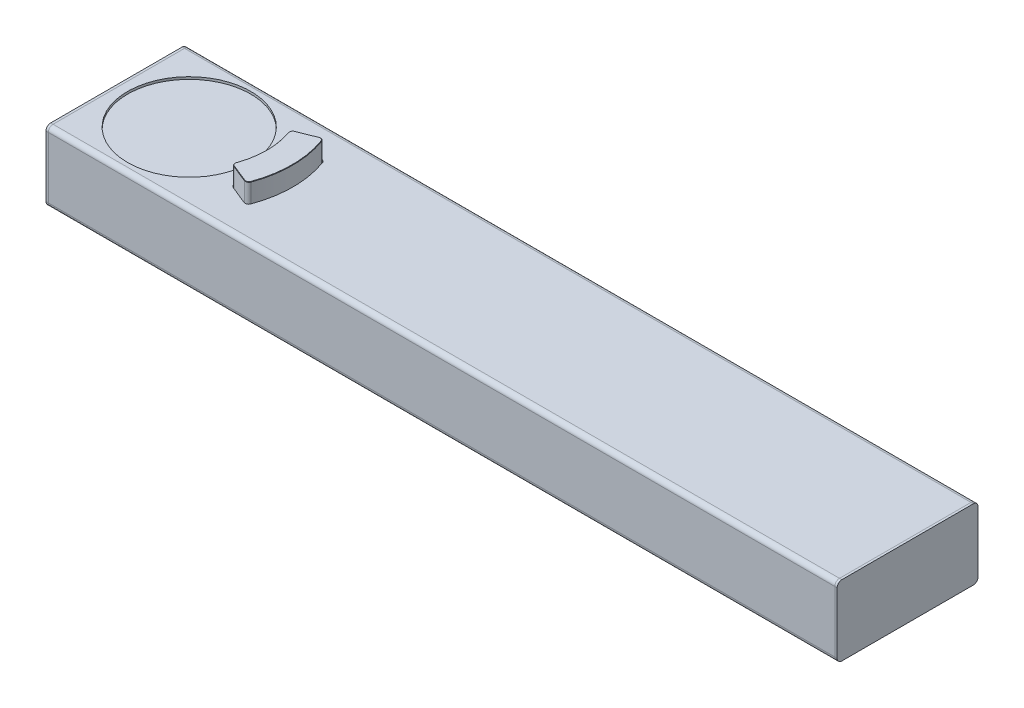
ISO-10303-21;
HEADER;
FILE_DESCRIPTION(('STEP AP214'),'2;1');
FILE_NAME('part.step','',(''),(''),'','','');
FILE_SCHEMA(('AUTOMOTIVE_DESIGN { 1 0 10303 214 1 1 1 1 }'));
ENDSEC;
DATA;
#1=APPLICATION_CONTEXT('core data for automotive mechanical design processes');
#2=APPLICATION_PROTOCOL_DEFINITION('international standard','automotive_design',2000,#1);
#3=PRODUCT_CONTEXT('',#1,'mechanical');
#4=PRODUCT('Part','Part','',(#3));
#5=PRODUCT_RELATED_PRODUCT_CATEGORY('part','',(#4));
#6=PRODUCT_DEFINITION_FORMATION('','',#4);
#7=PRODUCT_DEFINITION_CONTEXT('part definition',#1,'design');
#8=PRODUCT_DEFINITION('design','',#6,#7);
#9=PRODUCT_DEFINITION_SHAPE('','',#8);
#10=(LENGTH_UNIT() NAMED_UNIT(*) SI_UNIT(.MILLI.,.METRE.));
#11=(NAMED_UNIT(*) PLANE_ANGLE_UNIT() SI_UNIT($,.RADIAN.));
#12=(NAMED_UNIT(*) SI_UNIT($,.STERADIAN.) SOLID_ANGLE_UNIT());
#13=UNCERTAINTY_MEASURE_WITH_UNIT(LENGTH_MEASURE(1.E-05),#10,'distance_accuracy_value','');
#14=(GEOMETRIC_REPRESENTATION_CONTEXT(3) GLOBAL_UNCERTAINTY_ASSIGNED_CONTEXT((#13)) GLOBAL_UNIT_ASSIGNED_CONTEXT((#10,
#11,#12)) REPRESENTATION_CONTEXT('',''));
#15=CARTESIAN_POINT('',(0.,0.,0.));
#16=DIRECTION('',(0.,0.,1.));
#17=DIRECTION('',(1.,0.,0.));
#18=AXIS2_PLACEMENT_3D('',#15,#16,#17);
#19=CARTESIAN_POINT('',(-125.900711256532,25.4682341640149,54.8234853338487));
#20=DIRECTION('',(0.,1.,0.));
#21=DIRECTION('',(0.,0.,1.));
#22=AXIS2_PLACEMENT_3D('',#19,#20,#21);
#23=PLANE('',#22);
#24=CARTESIAN_POINT('',(131.,25.4682341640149,20.));
#25=DIRECTION('',(0.,-1.,0.));
#26=DIRECTION('',(0.,0.,-1.));
#27=AXIS2_PLACEMENT_3D('',#24,#25,#26);
#28=CIRCLE('',#27,1.24999999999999);
#29=CARTESIAN_POINT('',(131.,25.4682341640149,18.75));
#30=VERTEX_POINT('',#29);
#31=EDGE_CURVE('P0_E19',#30,#30,#28,.F.);
#32=ORIENTED_EDGE('',*,*,#31,.T.);
#33=EDGE_LOOP('',(#32));
#34=FACE_BOUND('',#33,.T.);
#35=ADVANCED_FACE('P0_F16',(#34),#23,.T.);
#36=CARTESIAN_POINT('',(-125.900711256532,25.4682341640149,54.8234853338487));
#37=DIRECTION('',(0.,1.,0.));
#38=DIRECTION('',(0.,0.,1.));
#39=AXIS2_PLACEMENT_3D('',#36,#37,#38);
#40=PLANE('',#39);
#41=CARTESIAN_POINT('',(131.,25.4682341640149,-20.));
#42=DIRECTION('',(0.,-1.,0.));
#43=DIRECTION('',(0.,0.,-1.));
#44=AXIS2_PLACEMENT_3D('',#41,#42,#43);
#45=CIRCLE('',#44,1.24999999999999);
#46=CARTESIAN_POINT('',(131.,25.4682341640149,-21.25));
#47=VERTEX_POINT('',#46);
#48=EDGE_CURVE('P0_E274',#47,#47,#45,.F.);
#49=ORIENTED_EDGE('',*,*,#48,.T.);
#50=EDGE_LOOP('',(#49));
#51=FACE_BOUND('',#50,.T.);
#52=ADVANCED_FACE('P0_F285',(#51),#40,.T.);
#53=CARTESIAN_POINT('',(131.,22.,20.));
#54=DIRECTION('',(0.,-1.,0.));
#55=DIRECTION('',(0.,0.,-1.));
#56=AXIS2_PLACEMENT_3D('',#53,#54,#55);
#57=CYLINDRICAL_SURFACE('',#56,1.24999999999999);
#58=CARTESIAN_POINT('',(131.,28.,20.));
#59=DIRECTION('',(0.,-1.,0.));
#60=DIRECTION('',(0.,0.,-1.));
#61=AXIS2_PLACEMENT_3D('',#58,#59,#60);
#62=CIRCLE('',#61,1.24999999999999);
#63=CARTESIAN_POINT('',(131.,28.,18.75));
#64=VERTEX_POINT('',#63);
#65=EDGE_CURVE('P0_E272',#64,#64,#62,.T.);
#66=ORIENTED_EDGE('',*,*,#65,.F.);
#67=EDGE_LOOP('',(#66));
#68=FACE_BOUND('',#67,.T.);
#69=ORIENTED_EDGE('',*,*,#31,.F.);
#70=EDGE_LOOP('',(#69));
#71=FACE_BOUND('',#70,.T.);
#72=ADVANCED_FACE('P0_F282',(#68,#71),#57,.F.);
#73=CARTESIAN_POINT('',(131.,22.,-20.));
#74=DIRECTION('',(0.,-1.,0.));
#75=DIRECTION('',(0.,0.,-1.));
#76=AXIS2_PLACEMENT_3D('',#73,#74,#75);
#77=CYLINDRICAL_SURFACE('',#76,1.24999999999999);
#78=CARTESIAN_POINT('',(131.,28.,-20.));
#79=DIRECTION('',(0.,-1.,0.));
#80=DIRECTION('',(0.,0.,-1.));
#81=AXIS2_PLACEMENT_3D('',#78,#79,#80);
#82=CIRCLE('',#81,1.24999999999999);
#83=CARTESIAN_POINT('',(131.,28.,-21.25));
#84=VERTEX_POINT('',#83);
#85=EDGE_CURVE('P0_E269',#84,#84,#82,.T.);
#86=ORIENTED_EDGE('',*,*,#85,.F.);
#87=EDGE_LOOP('',(#86));
#88=FACE_BOUND('',#87,.T.);
#89=ORIENTED_EDGE('',*,*,#48,.F.);
#90=EDGE_LOOP('',(#89));
#91=FACE_BOUND('',#90,.T.);
#92=ADVANCED_FACE('P0_F284',(#88,#91),#77,.F.);
#93=CARTESIAN_POINT('',(135.220931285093,28.,29.5779002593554));
#94=DIRECTION('',(0.,1.,0.));
#95=DIRECTION('',(0.,0.,1.));
#96=AXIS2_PLACEMENT_3D('',#93,#94,#95);
#97=PLANE('',#96);
#98=CARTESIAN_POINT('',(119.474639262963,28.,23.1359221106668));
#99=DIRECTION('',(0.,1.,0.));
#100=DIRECTION('',(0.,0.,1.));
#101=AXIS2_PLACEMENT_3D('',#98,#99,#100);
#102=CIRCLE('',#101,3.00000000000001);
#103=CARTESIAN_POINT('',(116.650932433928,28.,22.122670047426));
#104=VERTEX_POINT('',#103);
#105=CARTESIAN_POINT('',(118.338693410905,28.,25.9125436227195));
#106=VERTEX_POINT('',#105);
#107=EDGE_CURVE('P0_E174',#104,#106,#102,.T.);
#108=ORIENTED_EDGE('',*,*,#107,.T.);
#109=DIRECTION('',(0.925540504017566,0.,0.378648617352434));
#110=VECTOR('',#109,1.);
#111=CARTESIAN_POINT('',(118.338693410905,28.,25.9125436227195));
#112=LINE('',#111,#110);
#113=CARTESIAN_POINT('',(134.084985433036,28.,32.3545217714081));
#114=VERTEX_POINT('',#113);
#115=EDGE_CURVE('P0_E166',#106,#114,#112,.T.);
#116=ORIENTED_EDGE('',*,*,#115,.T.);
#117=CARTESIAN_POINT('',(135.220931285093,28.,29.5779002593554));
#118=DIRECTION('',(0.,1.,0.));
#119=DIRECTION('',(0.,0.,1.));
#120=AXIS2_PLACEMENT_3D('',#117,#118,#119);
#121=CIRCLE('',#120,3.);
#122=CARTESIAN_POINT('',(138.035700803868,28.,30.6157213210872));
#123=VERTEX_POINT('',#122);
#124=EDGE_CURVE('P0_E151',#114,#123,#121,.T.);
#125=ORIENTED_EDGE('',*,*,#124,.T.);
#126=CARTESIAN_POINT('',(55.,28.,0.));
#127=DIRECTION('',(0.,1.,0.));
#128=DIRECTION('',(0.,0.,1.));
#129=AXIS2_PLACEMENT_3D('',#126,#127,#128);
#130=CIRCLE('',#129,88.5);
#131=CARTESIAN_POINT('',(138.035700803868,28.,-30.6157213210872));
#132=VERTEX_POINT('',#131);
#133=EDGE_CURVE('P0_E257',#123,#132,#130,.T.);
#134=ORIENTED_EDGE('',*,*,#133,.T.);
#135=CARTESIAN_POINT('',(135.220931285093,28.,-29.5779002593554));
#136=DIRECTION('',(0.,1.,0.));
#137=DIRECTION('',(0.,0.,1.));
#138=AXIS2_PLACEMENT_3D('',#135,#136,#137);
#139=CIRCLE('',#138,3.00000000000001);
#140=CARTESIAN_POINT('',(134.084985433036,28.,-32.3545217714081));
#141=VERTEX_POINT('',#140);
#142=EDGE_CURVE('P0_E267',#132,#141,#139,.T.);
#143=ORIENTED_EDGE('',*,*,#142,.T.);
#144=DIRECTION('',(-0.925540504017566,0.,0.378648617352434));
#145=VECTOR('',#144,1.);
#146=CARTESIAN_POINT('',(118.338693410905,28.,-25.9125436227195));
#147=LINE('',#146,#145);
#148=CARTESIAN_POINT('',(118.338693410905,28.,-25.9125436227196));
#149=VERTEX_POINT('',#148);
#150=EDGE_CURVE('P0_E182',#141,#149,#147,.T.);
#151=ORIENTED_EDGE('',*,*,#150,.T.);
#152=CARTESIAN_POINT('',(119.474639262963,28.,-23.1359221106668));
#153=DIRECTION('',(0.,1.,0.));
#154=DIRECTION('',(0.,0.,1.));
#155=AXIS2_PLACEMENT_3D('',#152,#153,#154);
#156=CIRCLE('',#155,3.00000000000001);
#157=CARTESIAN_POINT('',(116.650932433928,28.,-22.122670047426));
#158=VERTEX_POINT('',#157);
#159=EDGE_CURVE('P0_E264',#149,#158,#156,.T.);
#160=ORIENTED_EDGE('',*,*,#159,.T.);
#161=CARTESIAN_POINT('',(55.,28.,0.));
#162=DIRECTION('',(0.,1.,0.));
#163=DIRECTION('',(0.,0.,1.));
#164=AXIS2_PLACEMENT_3D('',#161,#162,#163);
#165=CIRCLE('',#164,65.5);
#166=EDGE_CURVE('P0_E261',#104,#158,#165,.T.);
#167=ORIENTED_EDGE('',*,*,#166,.F.);
#168=EDGE_LOOP('',(#108,#116,#125,#134,#143,#151,#160,#167));
#169=FACE_BOUND('',#168,.T.);
#170=ORIENTED_EDGE('',*,*,#85,.T.);
#171=EDGE_LOOP('',(#170));
#172=FACE_BOUND('',#171,.T.);
#173=ORIENTED_EDGE('',*,*,#65,.T.);
#174=EDGE_LOOP('',(#173));
#175=FACE_BOUND('',#174,.T.);
#176=ADVANCED_FACE('P0_F171',(#169,#172,#175),#97,.T.);
#177=CARTESIAN_POINT('',(55.,28.,0.));
#178=DIRECTION('',(0.,1.,0.));
#179=DIRECTION('',(0.,0.,1.));
#180=AXIS2_PLACEMENT_3D('',#177,#178,#179);
#181=PLANE('',#180);
#182=CARTESIAN_POINT('',(55.,28.,0.));
#183=DIRECTION('',(0.,1.,0.));
#184=DIRECTION('',(0.,0.,1.));
#185=AXIS2_PLACEMENT_3D('',#182,#183,#184);
#186=CIRCLE('',#185,52.5);
#187=CARTESIAN_POINT('',(55.,28.,52.5));
#188=VERTEX_POINT('',#187);
#189=EDGE_CURVE('P0_E253',#188,#188,#186,.T.);
#190=ORIENTED_EDGE('',*,*,#189,.T.);
#191=EDGE_LOOP('',(#190));
#192=FACE_BOUND('',#191,.T.);
#193=ADVANCED_FACE('P0_F399',(#192),#181,.T.);
#194=CARTESIAN_POINT('',(135.220931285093,28.,-29.5779002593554));
#195=DIRECTION('',(0.,1.,0.));
#196=DIRECTION('',(0.,0.,1.));
#197=AXIS2_PLACEMENT_3D('',#194,#195,#196);
#198=CYLINDRICAL_SURFACE('',#197,3.00000000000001);
#199=DIRECTION('',(0.,1.,0.));
#200=VECTOR('',#199,1.);
#201=CARTESIAN_POINT('',(134.084985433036,28.,-32.3545217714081));
#202=LINE('',#201,#200);
#203=CARTESIAN_POINT('',(134.084985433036,30.,-32.3545217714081));
#204=VERTEX_POINT('',#203);
#205=EDGE_CURVE('P0_E180',#204,#141,#202,.F.);
#206=ORIENTED_EDGE('',*,*,#205,.T.);
#207=ORIENTED_EDGE('',*,*,#142,.F.);
#208=DIRECTION('',(0.,1.,0.));
#209=VECTOR('',#208,1.);
#210=CARTESIAN_POINT('',(138.035700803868,28.,-30.6157213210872));
#211=LINE('',#210,#209);
#212=CARTESIAN_POINT('',(138.035700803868,30.,-30.6157213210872));
#213=VERTEX_POINT('',#212);
#214=EDGE_CURVE('P0_E256',#132,#213,#211,.T.);
#215=ORIENTED_EDGE('',*,*,#214,.T.);
#216=CARTESIAN_POINT('',(135.220931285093,30.,-29.5779002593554));
#217=DIRECTION('',(0.,1.,0.));
#218=DIRECTION('',(0.,0.,1.));
#219=AXIS2_PLACEMENT_3D('',#216,#217,#218);
#220=CIRCLE('',#219,3.00000000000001);
#221=EDGE_CURVE('P0_E250',#213,#204,#220,.T.);
#222=ORIENTED_EDGE('',*,*,#221,.T.);
#223=EDGE_LOOP('',(#206,#207,#215,#222));
#224=FACE_BOUND('',#223,.T.);
#225=ADVANCED_FACE('P0_F395',(#224),#198,.F.);
#226=CARTESIAN_POINT('',(118.338693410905,28.,-25.9125436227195));
#227=DIRECTION('',(-0.378648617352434,0.,-0.925540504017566));
#228=DIRECTION('',(-0.925540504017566,0.,0.378648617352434));
#229=AXIS2_PLACEMENT_3D('',#226,#227,#228);
#230=PLANE('',#229);
#231=DIRECTION('',(0.,1.,0.));
#232=VECTOR('',#231,1.);
#233=CARTESIAN_POINT('',(118.338693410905,28.,-25.9125436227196));
#234=LINE('',#233,#232);
#235=CARTESIAN_POINT('',(118.338693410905,30.,-25.9125436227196));
#236=VERTEX_POINT('',#235);
#237=EDGE_CURVE('P0_E183',#236,#149,#234,.F.);
#238=ORIENTED_EDGE('',*,*,#237,.T.);
#239=ORIENTED_EDGE('',*,*,#150,.F.);
#240=ORIENTED_EDGE('',*,*,#205,.F.);
#241=DIRECTION('',(-0.925540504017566,0.,0.378648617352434));
#242=VECTOR('',#241,1.);
#243=CARTESIAN_POINT('',(134.084985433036,30.,-32.3545217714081));
#244=LINE('',#243,#242);
#245=EDGE_CURVE('P0_E249',#204,#236,#244,.T.);
#246=ORIENTED_EDGE('',*,*,#245,.T.);
#247=EDGE_LOOP('',(#238,#239,#240,#246));
#248=FACE_BOUND('',#247,.T.);
#249=ADVANCED_FACE('P0_F391',(#248),#230,.F.);
#250=CARTESIAN_POINT('',(119.474639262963,28.,-23.1359221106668));
#251=DIRECTION('',(0.,1.,0.));
#252=DIRECTION('',(0.,0.,1.));
#253=AXIS2_PLACEMENT_3D('',#250,#251,#252);
#254=CYLINDRICAL_SURFACE('',#253,3.00000000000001);
#255=DIRECTION('',(0.,1.,0.));
#256=VECTOR('',#255,1.);
#257=CARTESIAN_POINT('',(116.650932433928,28.,-22.122670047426));
#258=LINE('',#257,#256);
#259=CARTESIAN_POINT('',(116.650932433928,30.,-22.122670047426));
#260=VERTEX_POINT('',#259);
#261=EDGE_CURVE('P0_E263',#158,#260,#258,.T.);
#262=ORIENTED_EDGE('',*,*,#261,.F.);
#263=ORIENTED_EDGE('',*,*,#159,.F.);
#264=ORIENTED_EDGE('',*,*,#237,.F.);
#265=CARTESIAN_POINT('',(119.474639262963,30.,-23.1359221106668));
#266=DIRECTION('',(0.,1.,0.));
#267=DIRECTION('',(0.,0.,1.));
#268=AXIS2_PLACEMENT_3D('',#265,#266,#267);
#269=CIRCLE('',#268,3.00000000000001);
#270=EDGE_CURVE('P0_E246',#236,#260,#269,.T.);
#271=ORIENTED_EDGE('',*,*,#270,.T.);
#272=EDGE_LOOP('',(#262,#263,#264,#271));
#273=FACE_BOUND('',#272,.T.);
#274=ADVANCED_FACE('P0_F387',(#273),#254,.F.);
#275=CARTESIAN_POINT('',(55.,28.,0.));
#276=DIRECTION('',(0.,1.,0.));
#277=DIRECTION('',(0.,0.,1.));
#278=AXIS2_PLACEMENT_3D('',#275,#276,#277);
#279=CYLINDRICAL_SURFACE('',#278,65.5);
#280=ORIENTED_EDGE('',*,*,#166,.T.);
#281=ORIENTED_EDGE('',*,*,#261,.T.);
#282=CARTESIAN_POINT('',(55.,30.,0.));
#283=DIRECTION('',(0.,1.,0.));
#284=DIRECTION('',(0.,0.,1.));
#285=AXIS2_PLACEMENT_3D('',#282,#283,#284);
#286=CIRCLE('',#285,65.5);
#287=CARTESIAN_POINT('',(116.650932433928,30.,22.122670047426));
#288=VERTEX_POINT('',#287);
#289=EDGE_CURVE('P0_E243',#260,#288,#286,.F.);
#290=ORIENTED_EDGE('',*,*,#289,.T.);
#291=DIRECTION('',(0.,1.,0.));
#292=VECTOR('',#291,1.);
#293=CARTESIAN_POINT('',(116.650932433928,28.,22.122670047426));
#294=LINE('',#293,#292);
#295=EDGE_CURVE('P0_E260',#288,#104,#294,.F.);
#296=ORIENTED_EDGE('',*,*,#295,.T.);
#297=EDGE_LOOP('',(#280,#281,#290,#296));
#298=FACE_BOUND('',#297,.T.);
#299=ADVANCED_FACE('P0_F383',(#298),#279,.T.);
#300=CARTESIAN_POINT('',(119.474639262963,28.,23.1359221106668));
#301=DIRECTION('',(0.,1.,0.));
#302=DIRECTION('',(0.,0.,1.));
#303=AXIS2_PLACEMENT_3D('',#300,#301,#302);
#304=CYLINDRICAL_SURFACE('',#303,3.00000000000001);
#305=DIRECTION('',(0.,1.,0.));
#306=VECTOR('',#305,1.);
#307=CARTESIAN_POINT('',(118.338693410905,28.,25.9125436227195));
#308=LINE('',#307,#306);
#309=CARTESIAN_POINT('',(118.338693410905,30.,25.9125436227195));
#310=VERTEX_POINT('',#309);
#311=EDGE_CURVE('P0_E175',#310,#106,#308,.F.);
#312=ORIENTED_EDGE('',*,*,#311,.T.);
#313=ORIENTED_EDGE('',*,*,#107,.F.);
#314=ORIENTED_EDGE('',*,*,#295,.F.);
#315=CARTESIAN_POINT('',(119.474639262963,30.,23.1359221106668));
#316=DIRECTION('',(0.,1.,0.));
#317=DIRECTION('',(0.,0.,1.));
#318=AXIS2_PLACEMENT_3D('',#315,#316,#317);
#319=CIRCLE('',#318,3.00000000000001);
#320=EDGE_CURVE('P0_E240',#288,#310,#319,.T.);
#321=ORIENTED_EDGE('',*,*,#320,.T.);
#322=EDGE_LOOP('',(#312,#313,#314,#321));
#323=FACE_BOUND('',#322,.T.);
#324=ADVANCED_FACE('P0_F380',(#323),#304,.F.);
#325=CARTESIAN_POINT('',(118.338693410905,28.,25.9125436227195));
#326=DIRECTION('',(-0.378648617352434,0.,0.925540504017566));
#327=DIRECTION('',(0.925540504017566,0.,0.378648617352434));
#328=AXIS2_PLACEMENT_3D('',#325,#326,#327);
#329=PLANE('',#328);
#330=DIRECTION('',(0.,1.,0.));
#331=VECTOR('',#330,1.);
#332=CARTESIAN_POINT('',(134.084985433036,28.,32.3545217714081));
#333=LINE('',#332,#331);
#334=CARTESIAN_POINT('',(134.084985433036,30.,32.3545217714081));
#335=VERTEX_POINT('',#334);
#336=EDGE_CURVE('P0_E155',#114,#335,#333,.T.);
#337=ORIENTED_EDGE('',*,*,#336,.F.);
#338=ORIENTED_EDGE('',*,*,#115,.F.);
#339=ORIENTED_EDGE('',*,*,#311,.F.);
#340=DIRECTION('',(0.925540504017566,0.,0.378648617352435));
#341=VECTOR('',#340,1.);
#342=CARTESIAN_POINT('',(118.338693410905,30.,25.9125436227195));
#343=LINE('',#342,#341);
#344=EDGE_CURVE('P0_E169',#310,#335,#343,.T.);
#345=ORIENTED_EDGE('',*,*,#344,.T.);
#346=EDGE_LOOP('',(#337,#338,#339,#345));
#347=FACE_BOUND('',#346,.T.);
#348=ADVANCED_FACE('P0_F165',(#347),#329,.F.);
#349=CARTESIAN_POINT('',(135.220931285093,28.,29.5779002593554));
#350=DIRECTION('',(0.,1.,0.));
#351=DIRECTION('',(0.,0.,1.));
#352=AXIS2_PLACEMENT_3D('',#349,#350,#351);
#353=CYLINDRICAL_SURFACE('',#352,3.);
#354=ORIENTED_EDGE('',*,*,#124,.F.);
#355=ORIENTED_EDGE('',*,*,#336,.T.);
#356=CARTESIAN_POINT('',(135.220931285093,30.,29.5779002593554));
#357=DIRECTION('',(0.,1.,0.));
#358=DIRECTION('',(0.,0.,1.));
#359=AXIS2_PLACEMENT_3D('',#356,#357,#358);
#360=CIRCLE('',#359,3.);
#361=CARTESIAN_POINT('',(138.035700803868,30.,30.6157213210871));
#362=VERTEX_POINT('',#361);
#363=EDGE_CURVE('P0_E238',#335,#362,#360,.T.);
#364=ORIENTED_EDGE('',*,*,#363,.T.);
#365=DIRECTION('',(0.,1.,0.));
#366=VECTOR('',#365,1.);
#367=CARTESIAN_POINT('',(138.035700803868,28.,30.6157213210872));
#368=LINE('',#367,#366);
#369=EDGE_CURVE('P0_E157',#362,#123,#368,.F.);
#370=ORIENTED_EDGE('',*,*,#369,.T.);
#371=EDGE_LOOP('',(#354,#355,#364,#370));
#372=FACE_BOUND('',#371,.T.);
#373=ADVANCED_FACE('P0_F153',(#372),#353,.F.);
#374=CARTESIAN_POINT('',(55.,28.,0.));
#375=DIRECTION('',(0.,1.,0.));
#376=DIRECTION('',(0.,0.,1.));
#377=AXIS2_PLACEMENT_3D('',#374,#375,#376);
#378=CYLINDRICAL_SURFACE('',#377,88.5);
#379=ORIENTED_EDGE('',*,*,#214,.F.);
#380=ORIENTED_EDGE('',*,*,#133,.F.);
#381=ORIENTED_EDGE('',*,*,#369,.F.);
#382=CARTESIAN_POINT('',(55.,30.,0.));
#383=DIRECTION('',(0.,1.,0.));
#384=DIRECTION('',(0.,0.,1.));
#385=AXIS2_PLACEMENT_3D('',#382,#383,#384);
#386=CIRCLE('',#385,88.5);
#387=EDGE_CURVE('P0_E235',#362,#213,#386,.T.);
#388=ORIENTED_EDGE('',*,*,#387,.T.);
#389=EDGE_LOOP('',(#379,#380,#381,#388));
#390=FACE_BOUND('',#389,.T.);
#391=ADVANCED_FACE('P0_F371',(#390),#378,.F.);
#392=CARTESIAN_POINT('',(55.,28.,0.));
#393=DIRECTION('',(0.,1.,0.));
#394=DIRECTION('',(0.,0.,1.));
#395=AXIS2_PLACEMENT_3D('',#392,#393,#394);
#396=CYLINDRICAL_SURFACE('',#395,52.5);
#397=ORIENTED_EDGE('',*,*,#189,.F.);
#398=EDGE_LOOP('',(#397));
#399=FACE_BOUND('',#398,.T.);
#400=CARTESIAN_POINT('',(55.,30.,0.));
#401=DIRECTION('',(0.,1.,0.));
#402=DIRECTION('',(0.,0.,1.));
#403=AXIS2_PLACEMENT_3D('',#400,#401,#402);
#404=CIRCLE('',#403,52.5);
#405=CARTESIAN_POINT('',(55.,30.,52.5));
#406=VERTEX_POINT('',#405);
#407=EDGE_CURVE('P0_E231',#406,#406,#404,.T.);
#408=ORIENTED_EDGE('',*,*,#407,.T.);
#409=EDGE_LOOP('',(#408));
#410=FACE_BOUND('',#409,.T.);
#411=ADVANCED_FACE('P0_F367',(#399,#410),#396,.F.);
#412=CARTESIAN_POINT('',(665.,26.,56.));
#413=DIRECTION('',(-1.,0.,0.));
#414=DIRECTION('',(0.,0.,1.));
#415=AXIS2_PLACEMENT_3D('',#412,#413,#414);
#416=CYLINDRICAL_SURFACE('',#415,4.);
#417=CARTESIAN_POINT('',(665.,26.,56.));
#418=DIRECTION('',(-1.,0.,0.));
#419=DIRECTION('',(0.,0.,1.));
#420=AXIS2_PLACEMENT_3D('',#417,#418,#419);
#421=CIRCLE('',#420,4.);
#422=CARTESIAN_POINT('',(665.,26.,60.));
#423=VERTEX_POINT('',#422);
#424=CARTESIAN_POINT('',(665.,30.,56.));
#425=VERTEX_POINT('',#424);
#426=EDGE_CURVE('P0_E219',#423,#425,#421,.T.);
#427=ORIENTED_EDGE('',*,*,#426,.T.);
#428=DIRECTION('',(1.,0.,0.));
#429=VECTOR('',#428,1.);
#430=CARTESIAN_POINT('',(665.,30.,56.));
#431=LINE('',#430,#429);
#432=CARTESIAN_POINT('',(-5.,30.,56.));
#433=VERTEX_POINT('',#432);
#434=EDGE_CURVE('P0_E234',#425,#433,#431,.F.);
#435=ORIENTED_EDGE('',*,*,#434,.T.);
#436=CARTESIAN_POINT('',(-5.,26.,56.));
#437=DIRECTION('',(-1.,0.,0.));
#438=DIRECTION('',(0.,0.,1.));
#439=AXIS2_PLACEMENT_3D('',#436,#437,#438);
#440=CIRCLE('',#439,4.);
#441=CARTESIAN_POINT('',(-5.,26.,60.));
#442=VERTEX_POINT('',#441);
#443=EDGE_CURVE('P0_E214',#442,#433,#440,.T.);
#444=ORIENTED_EDGE('',*,*,#443,.F.);
#445=DIRECTION('',(-1.,0.,0.));
#446=VECTOR('',#445,1.);
#447=CARTESIAN_POINT('',(665.,26.,60.));
#448=LINE('',#447,#446);
#449=EDGE_CURVE('P0_E572',#442,#423,#448,.F.);
#450=ORIENTED_EDGE('',*,*,#449,.T.);
#451=EDGE_LOOP('',(#427,#435,#444,#450));
#452=FACE_BOUND('',#451,.T.);
#453=ADVANCED_FACE('P0_F363',(#452),#416,.T.);
#454=CARTESIAN_POINT('',(665.,30.,56.));
#455=DIRECTION('',(0.,-1.,0.));
#456=DIRECTION('',(0.,0.,-1.));
#457=AXIS2_PLACEMENT_3D('',#454,#455,#456);
#458=PLANE('',#457);
#459=ORIENTED_EDGE('',*,*,#434,.F.);
#460=DIRECTION('',(0.,0.,1.));
#461=VECTOR('',#460,1.);
#462=CARTESIAN_POINT('',(665.,30.,56.));
#463=LINE('',#462,#461);
#464=CARTESIAN_POINT('',(665.,30.,-56.));
#465=VERTEX_POINT('',#464);
#466=EDGE_CURVE('P0_E230',#425,#465,#463,.F.);
#467=ORIENTED_EDGE('',*,*,#466,.T.);
#468=DIRECTION('',(-1.,0.,0.));
#469=VECTOR('',#468,1.);
#470=CARTESIAN_POINT('',(665.,30.,-56.));
#471=LINE('',#470,#469);
#472=CARTESIAN_POINT('',(-5.,30.,-56.));
#473=VERTEX_POINT('',#472);
#474=EDGE_CURVE('P0_E564',#473,#465,#471,.F.);
#475=ORIENTED_EDGE('',*,*,#474,.F.);
#476=DIRECTION('',(0.,0.,1.));
#477=VECTOR('',#476,1.);
#478=CARTESIAN_POINT('',(-5.,30.,56.));
#479=LINE('',#478,#477);
#480=EDGE_CURVE('P0_E213',#433,#473,#479,.F.);
#481=ORIENTED_EDGE('',*,*,#480,.F.);
#482=EDGE_LOOP('',(#459,#467,#475,#481));
#483=FACE_BOUND('',#482,.T.);
#484=ORIENTED_EDGE('',*,*,#407,.F.);
#485=EDGE_LOOP('',(#484));
#486=FACE_BOUND('',#485,.T.);
#487=ORIENTED_EDGE('',*,*,#363,.F.);
#488=ORIENTED_EDGE('',*,*,#344,.F.);
#489=ORIENTED_EDGE('',*,*,#320,.F.);
#490=ORIENTED_EDGE('',*,*,#289,.F.);
#491=ORIENTED_EDGE('',*,*,#270,.F.);
#492=ORIENTED_EDGE('',*,*,#245,.F.);
#493=ORIENTED_EDGE('',*,*,#221,.F.);
#494=ORIENTED_EDGE('',*,*,#387,.F.);
#495=EDGE_LOOP('',(#487,#488,#489,#490,#491,#492,#493,#494));
#496=FACE_BOUND('',#495,.T.);
#497=ADVANCED_FACE('P0_F359',(#483,#486,#496),#458,.F.);
#498=CARTESIAN_POINT('',(665.,26.,-56.));
#499=DIRECTION('',(-1.,0.,0.));
#500=DIRECTION('',(0.,0.,1.));
#501=AXIS2_PLACEMENT_3D('',#498,#499,#500);
#502=CYLINDRICAL_SURFACE('',#501,4.);
#503=CARTESIAN_POINT('',(665.,26.,-56.));
#504=DIRECTION('',(-1.,0.,0.));
#505=DIRECTION('',(0.,0.,1.));
#506=AXIS2_PLACEMENT_3D('',#503,#504,#505);
#507=CIRCLE('',#506,4.);
#508=CARTESIAN_POINT('',(665.,26.,-60.));
#509=VERTEX_POINT('',#508);
#510=EDGE_CURVE('P0_E227',#465,#509,#507,.T.);
#511=ORIENTED_EDGE('',*,*,#510,.T.);
#512=DIRECTION('',(1.,0.,0.));
#513=VECTOR('',#512,1.);
#514=CARTESIAN_POINT('',(665.,26.,-60.));
#515=LINE('',#514,#513);
#516=CARTESIAN_POINT('',(-5.,26.,-60.));
#517=VERTEX_POINT('',#516);
#518=EDGE_CURVE('P0_E567',#509,#517,#515,.F.);
#519=ORIENTED_EDGE('',*,*,#518,.T.);
#520=CARTESIAN_POINT('',(-5.,26.,-56.));
#521=DIRECTION('',(-1.,0.,0.));
#522=DIRECTION('',(0.,0.,1.));
#523=AXIS2_PLACEMENT_3D('',#520,#521,#522);
#524=CIRCLE('',#523,4.);
#525=EDGE_CURVE('P0_E211',#473,#517,#524,.T.);
#526=ORIENTED_EDGE('',*,*,#525,.F.);
#527=ORIENTED_EDGE('',*,*,#474,.T.);
#528=EDGE_LOOP('',(#511,#519,#526,#527));
#529=FACE_BOUND('',#528,.T.);
#530=ADVANCED_FACE('P0_F355',(#529),#502,.T.);
#531=CARTESIAN_POINT('',(665.,-26.,-60.));
#532=DIRECTION('',(0.,0.,1.));
#533=DIRECTION('',(1.,0.,0.));
#534=AXIS2_PLACEMENT_3D('',#531,#532,#533);
#535=PLANE('',#534);
#536=ORIENTED_EDGE('',*,*,#518,.F.);
#537=DIRECTION('',(0.,1.,0.));
#538=VECTOR('',#537,1.);
#539=CARTESIAN_POINT('',(665.,26.,-60.));
#540=LINE('',#539,#538);
#541=CARTESIAN_POINT('',(665.,-26.,-60.));
#542=VERTEX_POINT('',#541);
#543=EDGE_CURVE('P0_E226',#509,#542,#540,.F.);
#544=ORIENTED_EDGE('',*,*,#543,.T.);
#545=DIRECTION('',(-1.,0.,0.));
#546=VECTOR('',#545,1.);
#547=CARTESIAN_POINT('',(665.,-26.,-60.));
#548=LINE('',#547,#546);
#549=CARTESIAN_POINT('',(-5.,-26.,-60.));
#550=VERTEX_POINT('',#549);
#551=EDGE_CURVE('P0_E218',#550,#542,#548,.F.);
#552=ORIENTED_EDGE('',*,*,#551,.F.);
#553=DIRECTION('',(0.,1.,0.));
#554=VECTOR('',#553,1.);
#555=CARTESIAN_POINT('',(-5.,26.,-60.));
#556=LINE('',#555,#554);
#557=EDGE_CURVE('P0_E210',#517,#550,#556,.F.);
#558=ORIENTED_EDGE('',*,*,#557,.F.);
#559=EDGE_LOOP('',(#536,#544,#552,#558));
#560=FACE_BOUND('',#559,.T.);
#561=ADVANCED_FACE('P0_F351',(#560),#535,.F.);
#562=CARTESIAN_POINT('',(665.,-26.,60.));
#563=DIRECTION('',(0.,0.,-1.));
#564=DIRECTION('',(-1.,0.,0.));
#565=AXIS2_PLACEMENT_3D('',#562,#563,#564);
#566=PLANE('',#565);
#567=DIRECTION('',(-1.,0.,0.));
#568=VECTOR('',#567,1.);
#569=CARTESIAN_POINT('',(665.,-26.,60.));
#570=LINE('',#569,#568);
#571=CARTESIAN_POINT('',(665.,-26.,60.));
#572=VERTEX_POINT('',#571);
#573=CARTESIAN_POINT('',(-5.,-26.,60.));
#574=VERTEX_POINT('',#573);
#575=EDGE_CURVE('P0_E576',#572,#574,#570,.T.);
#576=ORIENTED_EDGE('',*,*,#575,.F.);
#577=DIRECTION('',(0.,1.,0.));
#578=VECTOR('',#577,1.);
#579=CARTESIAN_POINT('',(665.,26.,60.));
#580=LINE('',#579,#578);
#581=EDGE_CURVE('P0_E222',#572,#423,#580,.T.);
#582=ORIENTED_EDGE('',*,*,#581,.T.);
#583=ORIENTED_EDGE('',*,*,#449,.F.);
#584=DIRECTION('',(0.,1.,0.));
#585=VECTOR('',#584,1.);
#586=CARTESIAN_POINT('',(-5.,26.,60.));
#587=LINE('',#586,#585);
#588=EDGE_CURVE('P0_E204',#574,#442,#587,.T.);
#589=ORIENTED_EDGE('',*,*,#588,.F.);
#590=EDGE_LOOP('',(#576,#582,#583,#589));
#591=FACE_BOUND('',#590,.T.);
#592=ADVANCED_FACE('P0_F347',(#591),#566,.F.);
#593=CARTESIAN_POINT('',(527.,-28.5,2.70861791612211E-13));
#594=DIRECTION('',(0.,-1.,0.));
#595=DIRECTION('',(0.,0.,-1.));
#596=AXIS2_PLACEMENT_3D('',#593,#594,#595);
#597=PLANE('',#596);
#598=CARTESIAN_POINT('',(523.,-28.5,2.70616862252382E-13));
#599=DIRECTION('',(0.,-1.,0.));
#600=DIRECTION('',(0.,0.,-1.));
#601=AXIS2_PLACEMENT_3D('',#598,#599,#600);
#602=CIRCLE('',#601,0.999999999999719);
#603=CARTESIAN_POINT('',(523.,-28.5,0.999999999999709));
#604=VERTEX_POINT('',#603);
#605=CARTESIAN_POINT('',(523.,-28.5,-0.999999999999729));
#606=VERTEX_POINT('',#605);
#607=EDGE_CURVE('P0_E201',#604,#606,#602,.T.);
#608=ORIENTED_EDGE('',*,*,#607,.T.);
#609=DIRECTION('',(-1.,0.,0.));
#610=VECTOR('',#609,1.);
#611=CARTESIAN_POINT('',(527.,-28.5,-0.999999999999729));
#612=LINE('',#611,#610);
#613=CARTESIAN_POINT('',(527.,-28.5,-0.999999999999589));
#614=VERTEX_POINT('',#613);
#615=EDGE_CURVE('P0_E579',#606,#614,#612,.F.);
#616=ORIENTED_EDGE('',*,*,#615,.T.);
#617=CARTESIAN_POINT('',(527.,-28.5,2.70861791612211E-13));
#618=DIRECTION('',(0.,-1.,0.));
#619=DIRECTION('',(0.,0.,-1.));
#620=AXIS2_PLACEMENT_3D('',#617,#618,#619);
#621=CIRCLE('',#620,0.999999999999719);
#622=CARTESIAN_POINT('',(527.,-28.5,0.99999999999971));
#623=VERTEX_POINT('',#622);
#624=EDGE_CURVE('P0_E198',#614,#623,#621,.T.);
#625=ORIENTED_EDGE('',*,*,#624,.T.);
#626=DIRECTION('',(1.,0.,0.));
#627=VECTOR('',#626,1.);
#628=CARTESIAN_POINT('',(527.,-28.5,0.99999999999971));
#629=LINE('',#628,#627);
#630=EDGE_CURVE('P0_E581',#623,#604,#629,.F.);
#631=ORIENTED_EDGE('',*,*,#630,.T.);
#632=EDGE_LOOP('',(#608,#616,#625,#631));
#633=FACE_BOUND('',#632,.T.);
#634=ADVANCED_FACE('P0_F343',(#633),#597,.T.);
#635=CARTESIAN_POINT('',(605.,-25.,0.));
#636=DIRECTION('',(0.,1.,0.));
#637=DIRECTION('',(0.,0.,1.));
#638=AXIS2_PLACEMENT_3D('',#635,#636,#637);
#639=PLANE('',#638);
#640=CARTESIAN_POINT('',(605.,-25.,0.));
#641=DIRECTION('',(0.,-1.,0.));
#642=DIRECTION('',(0.,0.,-1.));
#643=AXIS2_PLACEMENT_3D('',#640,#641,#642);
#644=CIRCLE('',#643,22.1186757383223);
#645=CARTESIAN_POINT('',(605.,-25.,-22.1186757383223));
#646=VERTEX_POINT('',#645);
#647=EDGE_CURVE('P0_E193',#646,#646,#644,.T.);
#648=ORIENTED_EDGE('',*,*,#647,.T.);
#649=EDGE_LOOP('',(#648));
#650=FACE_BOUND('',#649,.T.);
#651=ADVANCED_FACE('P0_F339',(#650),#639,.F.);
#652=CARTESIAN_POINT('',(665.,-26.,56.));
#653=DIRECTION('',(-1.,0.,0.));
#654=DIRECTION('',(0.,0.,1.));
#655=AXIS2_PLACEMENT_3D('',#652,#653,#654);
#656=CYLINDRICAL_SURFACE('',#655,4.);
#657=CARTESIAN_POINT('',(665.,-26.,56.));
#658=DIRECTION('',(-1.,0.,0.));
#659=DIRECTION('',(0.,0.,1.));
#660=AXIS2_PLACEMENT_3D('',#657,#658,#659);
#661=CIRCLE('',#660,4.);
#662=CARTESIAN_POINT('',(665.,-30.,56.));
#663=VERTEX_POINT('',#662);
#664=EDGE_CURVE('P0_E223',#663,#572,#661,.T.);
#665=ORIENTED_EDGE('',*,*,#664,.T.);
#666=ORIENTED_EDGE('',*,*,#575,.T.);
#667=CARTESIAN_POINT('',(-5.,-26.,56.));
#668=DIRECTION('',(-1.,0.,0.));
#669=DIRECTION('',(0.,0.,1.));
#670=AXIS2_PLACEMENT_3D('',#667,#668,#669);
#671=CIRCLE('',#670,4.);
#672=CARTESIAN_POINT('',(-5.,-30.,56.));
#673=VERTEX_POINT('',#672);
#674=EDGE_CURVE('P0_E205',#673,#574,#671,.T.);
#675=ORIENTED_EDGE('',*,*,#674,.F.);
#676=DIRECTION('',(1.,0.,0.));
#677=VECTOR('',#676,1.);
#678=CARTESIAN_POINT('',(665.,-30.,56.));
#679=LINE('',#678,#677);
#680=EDGE_CURVE('P0_E196',#673,#663,#679,.T.);
#681=ORIENTED_EDGE('',*,*,#680,.T.);
#682=EDGE_LOOP('',(#665,#666,#675,#681));
#683=FACE_BOUND('',#682,.T.);
#684=ADVANCED_FACE('P0_F335',(#683),#656,.T.);
#685=CARTESIAN_POINT('',(665.,26.,56.));
#686=DIRECTION('',(-1.,0.,0.));
#687=DIRECTION('',(0.,0.,1.));
#688=AXIS2_PLACEMENT_3D('',#685,#686,#687);
#689=PLANE('',#688);
#690=ORIENTED_EDGE('',*,*,#581,.F.);
#691=ORIENTED_EDGE('',*,*,#664,.F.);
#692=DIRECTION('',(0.,0.,1.));
#693=VECTOR('',#692,1.);
#694=CARTESIAN_POINT('',(665.,-30.,56.));
#695=LINE('',#694,#693);
#696=CARTESIAN_POINT('',(665.,-30.,-56.));
#697=VERTEX_POINT('',#696);
#698=EDGE_CURVE('P0_E590',#663,#697,#695,.F.);
#699=ORIENTED_EDGE('',*,*,#698,.T.);
#700=CARTESIAN_POINT('',(665.,-26.,-56.));
#701=DIRECTION('',(-1.,0.,0.));
#702=DIRECTION('',(0.,0.,1.));
#703=AXIS2_PLACEMENT_3D('',#700,#701,#702);
#704=CIRCLE('',#703,4.);
#705=EDGE_CURVE('P0_E216',#542,#697,#704,.T.);
#706=ORIENTED_EDGE('',*,*,#705,.F.);
#707=ORIENTED_EDGE('',*,*,#543,.F.);
#708=ORIENTED_EDGE('',*,*,#510,.F.);
#709=ORIENTED_EDGE('',*,*,#466,.F.);
#710=ORIENTED_EDGE('',*,*,#426,.F.);
#711=EDGE_LOOP('',(#690,#691,#699,#706,#707,#708,#709,#710));
#712=FACE_BOUND('',#711,.T.);
#713=ADVANCED_FACE('P0_F331',(#712),#689,.F.);
#714=CARTESIAN_POINT('',(665.,-26.,-56.));
#715=DIRECTION('',(-1.,0.,0.));
#716=DIRECTION('',(0.,0.,1.));
#717=AXIS2_PLACEMENT_3D('',#714,#715,#716);
#718=CYLINDRICAL_SURFACE('',#717,4.);
#719=ORIENTED_EDGE('',*,*,#705,.T.);
#720=DIRECTION('',(1.,0.,0.));
#721=VECTOR('',#720,1.);
#722=CARTESIAN_POINT('',(665.,-30.,-56.));
#723=LINE('',#722,#721);
#724=CARTESIAN_POINT('',(-5.,-30.,-56.));
#725=VERTEX_POINT('',#724);
#726=EDGE_CURVE('P0_E593',#697,#725,#723,.F.);
#727=ORIENTED_EDGE('',*,*,#726,.T.);
#728=CARTESIAN_POINT('',(-5.,-26.,-56.));
#729=DIRECTION('',(-1.,0.,0.));
#730=DIRECTION('',(0.,0.,1.));
#731=AXIS2_PLACEMENT_3D('',#728,#729,#730);
#732=CIRCLE('',#731,4.);
#733=EDGE_CURVE('P0_E208',#550,#725,#732,.T.);
#734=ORIENTED_EDGE('',*,*,#733,.F.);
#735=ORIENTED_EDGE('',*,*,#551,.T.);
#736=EDGE_LOOP('',(#719,#727,#734,#735));
#737=FACE_BOUND('',#736,.T.);
#738=ADVANCED_FACE('P0_F327',(#737),#718,.T.);
#739=CARTESIAN_POINT('',(-5.,26.,56.));
#740=DIRECTION('',(-1.,0.,0.));
#741=DIRECTION('',(0.,0.,1.));
#742=AXIS2_PLACEMENT_3D('',#739,#740,#741);
#743=PLANE('',#742);
#744=ORIENTED_EDGE('',*,*,#674,.T.);
#745=ORIENTED_EDGE('',*,*,#588,.T.);
#746=ORIENTED_EDGE('',*,*,#443,.T.);
#747=ORIENTED_EDGE('',*,*,#480,.T.);
#748=ORIENTED_EDGE('',*,*,#525,.T.);
#749=ORIENTED_EDGE('',*,*,#557,.T.);
#750=ORIENTED_EDGE('',*,*,#733,.T.);
#751=DIRECTION('',(0.,0.,1.));
#752=VECTOR('',#751,1.);
#753=CARTESIAN_POINT('',(-5.,-30.,56.));
#754=LINE('',#753,#752);
#755=EDGE_CURVE('P0_E192',#725,#673,#754,.T.);
#756=ORIENTED_EDGE('',*,*,#755,.T.);
#757=EDGE_LOOP('',(#744,#745,#746,#747,#748,#749,#750,#756));
#758=FACE_BOUND('',#757,.T.);
#759=ADVANCED_FACE('P0_F323',(#758),#743,.T.);
#760=CARTESIAN_POINT('',(523.,-28.5,2.70616862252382E-13));
#761=DIRECTION('',(0.,-1.,0.));
#762=DIRECTION('',(0.,0.,-1.));
#763=AXIS2_PLACEMENT_3D('',#760,#761,#762);
#764=CYLINDRICAL_SURFACE('',#763,0.999999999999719);
#765=DIRECTION('',(0.,1.,0.));
#766=VECTOR('',#765,1.);
#767=CARTESIAN_POINT('',(523.,-28.5,-0.999999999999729));
#768=LINE('',#767,#766);
#769=CARTESIAN_POINT('',(523.,-30.,-0.99999999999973));
#770=VERTEX_POINT('',#769);
#771=EDGE_CURVE('P0_E203',#770,#606,#768,.T.);
#772=ORIENTED_EDGE('',*,*,#771,.T.);
#773=ORIENTED_EDGE('',*,*,#607,.F.);
#774=DIRECTION('',(0.,1.,0.));
#775=VECTOR('',#774,1.);
#776=CARTESIAN_POINT('',(523.,-28.5,0.999999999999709));
#777=LINE('',#776,#775);
#778=CARTESIAN_POINT('',(523.,-30.,0.999999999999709));
#779=VERTEX_POINT('',#778);
#780=EDGE_CURVE('P0_E197',#604,#779,#777,.F.);
#781=ORIENTED_EDGE('',*,*,#780,.T.);
#782=CARTESIAN_POINT('',(523.,-30.,2.70616862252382E-13));
#783=DIRECTION('',(0.,-1.,0.));
#784=DIRECTION('',(0.,0.,-1.));
#785=AXIS2_PLACEMENT_3D('',#782,#783,#784);
#786=CIRCLE('',#785,0.999999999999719);
#787=EDGE_CURVE('P0_E189',#779,#770,#786,.T.);
#788=ORIENTED_EDGE('',*,*,#787,.T.);
#789=EDGE_LOOP('',(#772,#773,#781,#788));
#790=FACE_BOUND('',#789,.T.);
#791=ADVANCED_FACE('P0_F319',(#790),#764,.F.);
#792=CARTESIAN_POINT('',(527.,-28.5,-0.999999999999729));
#793=DIRECTION('',(0.,0.,-1.));
#794=DIRECTION('',(-1.,0.,0.));
#795=AXIS2_PLACEMENT_3D('',#792,#793,#794);
#796=PLANE('',#795);
#797=DIRECTION('',(0.,-1.,0.));
#798=VECTOR('',#797,1.);
#799=CARTESIAN_POINT('',(527.,-28.5,-0.999999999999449));
#800=LINE('',#799,#798);
#801=CARTESIAN_POINT('',(527.,-30.,-0.999999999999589));
#802=VERTEX_POINT('',#801);
#803=EDGE_CURVE('P0_E200',#802,#614,#800,.F.);
#804=ORIENTED_EDGE('',*,*,#803,.T.);
#805=ORIENTED_EDGE('',*,*,#615,.F.);
#806=ORIENTED_EDGE('',*,*,#771,.F.);
#807=DIRECTION('',(1.,0.,0.));
#808=VECTOR('',#807,1.);
#809=CARTESIAN_POINT('',(665.,-30.,-0.99999999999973));
#810=LINE('',#809,#808);
#811=EDGE_CURVE('P0_E188',#770,#802,#810,.T.);
#812=ORIENTED_EDGE('',*,*,#811,.T.);
#813=EDGE_LOOP('',(#804,#805,#806,#812));
#814=FACE_BOUND('',#813,.T.);
#815=ADVANCED_FACE('P0_F315',(#814),#796,.F.);
#816=CARTESIAN_POINT('',(527.,-28.5,2.70861791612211E-13));
#817=DIRECTION('',(0.,-1.,0.));
#818=DIRECTION('',(0.,0.,-1.));
#819=AXIS2_PLACEMENT_3D('',#816,#817,#818);
#820=CYLINDRICAL_SURFACE('',#819,0.999999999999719);
#821=DIRECTION('',(0.,1.,0.));
#822=VECTOR('',#821,1.);
#823=CARTESIAN_POINT('',(527.,-28.5,0.99999999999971));
#824=LINE('',#823,#822);
#825=CARTESIAN_POINT('',(527.,-30.,0.999999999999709));
#826=VERTEX_POINT('',#825);
#827=EDGE_CURVE('P0_E34',#826,#623,#824,.T.);
#828=ORIENTED_EDGE('',*,*,#827,.T.);
#829=ORIENTED_EDGE('',*,*,#624,.F.);
#830=ORIENTED_EDGE('',*,*,#803,.F.);
#831=CARTESIAN_POINT('',(527.,-30.,2.70861791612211E-13));
#832=DIRECTION('',(0.,-1.,0.));
#833=DIRECTION('',(0.,0.,-1.));
#834=AXIS2_PLACEMENT_3D('',#831,#832,#833);
#835=CIRCLE('',#834,0.999999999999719);
#836=EDGE_CURVE('P0_E185',#802,#826,#835,.T.);
#837=ORIENTED_EDGE('',*,*,#836,.T.);
#838=EDGE_LOOP('',(#828,#829,#830,#837));
#839=FACE_BOUND('',#838,.T.);
#840=ADVANCED_FACE('P0_F312',(#839),#820,.F.);
#841=CARTESIAN_POINT('',(527.,-28.5,0.99999999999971));
#842=DIRECTION('',(0.,0.,1.));
#843=DIRECTION('',(1.,0.,0.));
#844=AXIS2_PLACEMENT_3D('',#841,#842,#843);
#845=PLANE('',#844);
#846=ORIENTED_EDGE('',*,*,#780,.F.);
#847=ORIENTED_EDGE('',*,*,#630,.F.);
#848=ORIENTED_EDGE('',*,*,#827,.F.);
#849=DIRECTION('',(1.,0.,0.));
#850=VECTOR('',#849,1.);
#851=CARTESIAN_POINT('',(665.,-30.,0.999999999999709));
#852=LINE('',#851,#850);
#853=EDGE_CURVE('P0_E25',#826,#779,#852,.F.);
#854=ORIENTED_EDGE('',*,*,#853,.T.);
#855=EDGE_LOOP('',(#846,#847,#848,#854));
#856=FACE_BOUND('',#855,.T.);
#857=ADVANCED_FACE('P0_F304',(#856),#845,.F.);
#858=CARTESIAN_POINT('',(605.,-25.,0.));
#859=DIRECTION('',(0.,-1.,0.));
#860=DIRECTION('',(0.,0.,-1.));
#861=AXIS2_PLACEMENT_3D('',#858,#859,#860);
#862=CYLINDRICAL_SURFACE('',#861,22.1186757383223);
#863=CARTESIAN_POINT('',(605.,-30.,0.));
#864=DIRECTION('',(0.,-1.,0.));
#865=DIRECTION('',(0.,0.,-1.));
#866=AXIS2_PLACEMENT_3D('',#863,#864,#865);
#867=CIRCLE('',#866,22.1186757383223);
#868=CARTESIAN_POINT('',(605.,-30.,-22.1186757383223));
#869=VERTEX_POINT('',#868);
#870=EDGE_CURVE('P0_E11',#869,#869,#867,.T.);
#871=ORIENTED_EDGE('',*,*,#870,.T.);
#872=EDGE_LOOP('',(#871));
#873=FACE_BOUND('',#872,.T.);
#874=ORIENTED_EDGE('',*,*,#647,.F.);
#875=EDGE_LOOP('',(#874));
#876=FACE_BOUND('',#875,.T.);
#877=ADVANCED_FACE('P0_F298',(#873,#876),#862,.F.);
#878=CARTESIAN_POINT('',(665.,-30.,56.));
#879=DIRECTION('',(0.,1.,0.));
#880=DIRECTION('',(0.,0.,1.));
#881=AXIS2_PLACEMENT_3D('',#878,#879,#880);
#882=PLANE('',#881);
#883=ORIENTED_EDGE('',*,*,#870,.F.);
#884=EDGE_LOOP('',(#883));
#885=FACE_BOUND('',#884,.T.);
#886=ORIENTED_EDGE('',*,*,#836,.F.);
#887=ORIENTED_EDGE('',*,*,#811,.F.);
#888=ORIENTED_EDGE('',*,*,#787,.F.);
#889=ORIENTED_EDGE('',*,*,#853,.F.);
#890=EDGE_LOOP('',(#886,#887,#888,#889));
#891=FACE_BOUND('',#890,.T.);
#892=ORIENTED_EDGE('',*,*,#726,.F.);
#893=ORIENTED_EDGE('',*,*,#698,.F.);
#894=ORIENTED_EDGE('',*,*,#680,.F.);
#895=ORIENTED_EDGE('',*,*,#755,.F.);
#896=EDGE_LOOP('',(#892,#893,#894,#895));
#897=FACE_BOUND('',#896,.T.);
#898=ADVANCED_FACE('P0_F296',(#885,#891,#897),#882,.F.);
#899=CLOSED_SHELL('',(#35,#52,#72,#92,#176,#193,#225,#249,#274,#299,#324,#348,#373,#391,#411,
#453,#497,#530,#561,#592,#634,#651,#684,#713,#738,#759,#791,#815,#840,#857,#877,#898));
#900=MANIFOLD_SOLID_BREP('P0_B1',#899);
#901=CARTESIAN_POINT('',(-7.,26.,56.));
#902=DIRECTION('',(-1.,0.,0.));
#903=DIRECTION('',(0.,0.,1.));
#904=AXIS2_PLACEMENT_3D('',#901,#902,#903);
#905=PLANE('',#904);
#906=CARTESIAN_POINT('',(-7.,-26.,56.));
#907=DIRECTION('',(-1.,0.,0.));
#908=DIRECTION('',(0.,0.,1.));
#909=AXIS2_PLACEMENT_3D('',#906,#907,#908);
#910=CIRCLE('',#909,4.);
#911=CARTESIAN_POINT('',(-7.,-26.,60.));
#912=VERTEX_POINT('',#911);
#913=CARTESIAN_POINT('',(-7.,-30.,56.));
#914=VERTEX_POINT('',#913);
#915=EDGE_CURVE('P1_E109',#912,#914,#910,.F.);
#916=ORIENTED_EDGE('',*,*,#915,.F.);
#917=DIRECTION('',(0.,1.,0.));
#918=VECTOR('',#917,1.);
#919=CARTESIAN_POINT('',(-7.,-26.,60.));
#920=LINE('',#919,#918);
#921=CARTESIAN_POINT('',(-7.,26.,60.));
#922=VERTEX_POINT('',#921);
#923=EDGE_CURVE('P1_E103',#912,#922,#920,.T.);
#924=ORIENTED_EDGE('',*,*,#923,.T.);
#925=CARTESIAN_POINT('',(-7.,26.,56.));
#926=DIRECTION('',(-1.,0.,0.));
#927=DIRECTION('',(0.,0.,1.));
#928=AXIS2_PLACEMENT_3D('',#925,#926,#927);
#929=CIRCLE('',#928,4.);
#930=CARTESIAN_POINT('',(-7.,30.,56.));
#931=VERTEX_POINT('',#930);
#932=EDGE_CURVE('P1_E90',#931,#922,#929,.F.);
#933=ORIENTED_EDGE('',*,*,#932,.F.);
#934=DIRECTION('',(0.,0.,-1.));
#935=VECTOR('',#934,1.);
#936=CARTESIAN_POINT('',(-7.,30.,56.));
#937=LINE('',#936,#935);
#938=CARTESIAN_POINT('',(-7.,30.,-56.));
#939=VERTEX_POINT('',#938);
#940=EDGE_CURVE('P1_E87',#931,#939,#937,.T.);
#941=ORIENTED_EDGE('',*,*,#940,.T.);
#942=CARTESIAN_POINT('',(-7.,26.,-56.));
#943=DIRECTION('',(-1.,0.,0.));
#944=DIRECTION('',(0.,0.,1.));
#945=AXIS2_PLACEMENT_3D('',#942,#943,#944);
#946=CIRCLE('',#945,4.);
#947=CARTESIAN_POINT('',(-7.,26.,-60.));
#948=VERTEX_POINT('',#947);
#949=EDGE_CURVE('P1_E19',#948,#939,#946,.F.);
#950=ORIENTED_EDGE('',*,*,#949,.F.);
#951=DIRECTION('',(0.,1.,0.));
#952=VECTOR('',#951,1.);
#953=CARTESIAN_POINT('',(-7.,-26.,-60.));
#954=LINE('',#953,#952);
#955=CARTESIAN_POINT('',(-7.,-26.,-60.));
#956=VERTEX_POINT('',#955);
#957=EDGE_CURVE('P1_E99',#948,#956,#954,.F.);
#958=ORIENTED_EDGE('',*,*,#957,.T.);
#959=CARTESIAN_POINT('',(-7.,-26.,-56.));
#960=DIRECTION('',(-1.,0.,0.));
#961=DIRECTION('',(0.,0.,1.));
#962=AXIS2_PLACEMENT_3D('',#959,#960,#961);
#963=CIRCLE('',#962,4.);
#964=CARTESIAN_POINT('',(-7.,-30.,-56.));
#965=VERTEX_POINT('',#964);
#966=EDGE_CURVE('P1_E111',#965,#956,#963,.F.);
#967=ORIENTED_EDGE('',*,*,#966,.F.);
#968=DIRECTION('',(0.,0.,1.));
#969=VECTOR('',#968,1.);
#970=CARTESIAN_POINT('',(-7.,-30.,56.));
#971=LINE('',#970,#969);
#972=EDGE_CURVE('P1_E106',#965,#914,#971,.T.);
#973=ORIENTED_EDGE('',*,*,#972,.T.);
#974=EDGE_LOOP('',(#916,#924,#933,#941,#950,#958,#967,#973));
#975=FACE_BOUND('',#974,.T.);
#976=ADVANCED_FACE('P1_F16',(#975),#905,.T.);
#977=CARTESIAN_POINT('',(-5.,30.,56.));
#978=DIRECTION('',(0.,-1.,0.));
#979=DIRECTION('',(0.,0.,-1.));
#980=AXIS2_PLACEMENT_3D('',#977,#978,#979);
#981=PLANE('',#980);
#982=DIRECTION('',(-1.,0.,0.));
#983=VECTOR('',#982,1.);
#984=CARTESIAN_POINT('',(-5.,30.,56.));
#985=LINE('',#984,#983);
#986=CARTESIAN_POINT('',(-5.,30.,56.));
#987=VERTEX_POINT('',#986);
#988=EDGE_CURVE('P1_E135',#987,#931,#985,.T.);
#989=ORIENTED_EDGE('',*,*,#988,.F.);
#990=DIRECTION('',(0.,0.,1.));
#991=VECTOR('',#990,1.);
#992=CARTESIAN_POINT('',(-5.,30.,56.));
#993=LINE('',#992,#991);
#994=CARTESIAN_POINT('',(-5.,30.,-56.));
#995=VERTEX_POINT('',#994);
#996=EDGE_CURVE('P1_E97',#987,#995,#993,.F.);
#997=ORIENTED_EDGE('',*,*,#996,.T.);
#998=DIRECTION('',(-1.,0.,0.));
#999=VECTOR('',#998,1.);
#1000=CARTESIAN_POINT('',(-5.,30.,-56.));
#1001=LINE('',#1000,#999);
#1002=EDGE_CURVE('P1_E84',#939,#995,#1001,.F.);
#1003=ORIENTED_EDGE('',*,*,#1002,.F.);
#1004=ORIENTED_EDGE('',*,*,#940,.F.);
#1005=EDGE_LOOP('',(#989,#997,#1003,#1004));
#1006=FACE_BOUND('',#1005,.T.);
#1007=ADVANCED_FACE('P1_F96',(#1006),#981,.F.);
#1008=CARTESIAN_POINT('',(-5.,26.,-56.));
#1009=DIRECTION('',(-1.,0.,0.));
#1010=DIRECTION('',(0.,0.,1.));
#1011=AXIS2_PLACEMENT_3D('',#1008,#1009,#1010);
#1012=CYLINDRICAL_SURFACE('',#1011,4.);
#1013=CARTESIAN_POINT('',(-5.,26.,-56.));
#1014=DIRECTION('',(-1.,0.,0.));
#1015=DIRECTION('',(0.,0.,1.));
#1016=AXIS2_PLACEMENT_3D('',#1013,#1014,#1015);
#1017=CIRCLE('',#1016,4.);
#1018=CARTESIAN_POINT('',(-5.,26.,-60.));
#1019=VERTEX_POINT('',#1018);
#1020=EDGE_CURVE('P1_E121',#995,#1019,#1017,.T.);
#1021=ORIENTED_EDGE('',*,*,#1020,.T.);
#1022=DIRECTION('',(1.,0.,0.));
#1023=VECTOR('',#1022,1.);
#1024=CARTESIAN_POINT('',(-5.,26.,-60.));
#1025=LINE('',#1024,#1023);
#1026=EDGE_CURVE('P1_E86',#1019,#948,#1025,.F.);
#1027=ORIENTED_EDGE('',*,*,#1026,.T.);
#1028=ORIENTED_EDGE('',*,*,#949,.T.);
#1029=ORIENTED_EDGE('',*,*,#1002,.T.);
#1030=EDGE_LOOP('',(#1021,#1027,#1028,#1029));
#1031=FACE_BOUND('',#1030,.T.);
#1032=ADVANCED_FACE('P1_F82',(#1031),#1012,.T.);
#1033=CARTESIAN_POINT('',(-5.,-26.,-60.));
#1034=DIRECTION('',(0.,0.,1.));
#1035=DIRECTION('',(1.,0.,0.));
#1036=AXIS2_PLACEMENT_3D('',#1033,#1034,#1035);
#1037=PLANE('',#1036);
#1038=ORIENTED_EDGE('',*,*,#1026,.F.);
#1039=DIRECTION('',(0.,1.,0.));
#1040=VECTOR('',#1039,1.);
#1041=CARTESIAN_POINT('',(-5.,26.,-60.));
#1042=LINE('',#1041,#1040);
#1043=CARTESIAN_POINT('',(-5.,-26.,-60.));
#1044=VERTEX_POINT('',#1043);
#1045=EDGE_CURVE('P1_E120',#1019,#1044,#1042,.F.);
#1046=ORIENTED_EDGE('',*,*,#1045,.T.);
#1047=DIRECTION('',(-1.,0.,0.));
#1048=VECTOR('',#1047,1.);
#1049=CARTESIAN_POINT('',(-5.,-26.,-60.));
#1050=LINE('',#1049,#1048);
#1051=EDGE_CURVE('P1_E125',#956,#1044,#1050,.F.);
#1052=ORIENTED_EDGE('',*,*,#1051,.F.);
#1053=ORIENTED_EDGE('',*,*,#957,.F.);
#1054=EDGE_LOOP('',(#1038,#1046,#1052,#1053));
#1055=FACE_BOUND('',#1054,.T.);
#1056=ADVANCED_FACE('P1_F161',(#1055),#1037,.F.);
#1057=CARTESIAN_POINT('',(-5.,-26.,-56.));
#1058=DIRECTION('',(-1.,0.,0.));
#1059=DIRECTION('',(0.,0.,1.));
#1060=AXIS2_PLACEMENT_3D('',#1057,#1058,#1059);
#1061=CYLINDRICAL_SURFACE('',#1060,4.);
#1062=CARTESIAN_POINT('',(-5.,-26.,-56.));
#1063=DIRECTION('',(-1.,0.,0.));
#1064=DIRECTION('',(0.,0.,1.));
#1065=AXIS2_PLACEMENT_3D('',#1062,#1063,#1064);
#1066=CIRCLE('',#1065,4.);
#1067=CARTESIAN_POINT('',(-5.,-30.,-56.));
#1068=VERTEX_POINT('',#1067);
#1069=EDGE_CURVE('P1_E117',#1044,#1068,#1066,.T.);
#1070=ORIENTED_EDGE('',*,*,#1069,.T.);
#1071=DIRECTION('',(1.,0.,0.));
#1072=VECTOR('',#1071,1.);
#1073=CARTESIAN_POINT('',(-5.,-30.,-56.));
#1074=LINE('',#1073,#1072);
#1075=EDGE_CURVE('P1_E110',#1068,#965,#1074,.F.);
#1076=ORIENTED_EDGE('',*,*,#1075,.T.);
#1077=ORIENTED_EDGE('',*,*,#966,.T.);
#1078=ORIENTED_EDGE('',*,*,#1051,.T.);
#1079=EDGE_LOOP('',(#1070,#1076,#1077,#1078));
#1080=FACE_BOUND('',#1079,.T.);
#1081=ADVANCED_FACE('P1_F159',(#1080),#1061,.T.);
#1082=CARTESIAN_POINT('',(-5.,-30.,56.));
#1083=DIRECTION('',(0.,1.,0.));
#1084=DIRECTION('',(0.,0.,1.));
#1085=AXIS2_PLACEMENT_3D('',#1082,#1083,#1084);
#1086=PLANE('',#1085);
#1087=ORIENTED_EDGE('',*,*,#1075,.F.);
#1088=DIRECTION('',(0.,0.,1.));
#1089=VECTOR('',#1088,1.);
#1090=CARTESIAN_POINT('',(-5.,-30.,56.));
#1091=LINE('',#1090,#1089);
#1092=CARTESIAN_POINT('',(-5.,-30.,56.));
#1093=VERTEX_POINT('',#1092);
#1094=EDGE_CURVE('P1_E116',#1068,#1093,#1091,.T.);
#1095=ORIENTED_EDGE('',*,*,#1094,.T.);
#1096=DIRECTION('',(-1.,0.,0.));
#1097=VECTOR('',#1096,1.);
#1098=CARTESIAN_POINT('',(-5.,-30.,56.));
#1099=LINE('',#1098,#1097);
#1100=EDGE_CURVE('P1_E124',#914,#1093,#1099,.F.);
#1101=ORIENTED_EDGE('',*,*,#1100,.F.);
#1102=ORIENTED_EDGE('',*,*,#972,.F.);
#1103=EDGE_LOOP('',(#1087,#1095,#1101,#1102));
#1104=FACE_BOUND('',#1103,.T.);
#1105=ADVANCED_FACE('P1_F157',(#1104),#1086,.F.);
#1106=CARTESIAN_POINT('',(-5.,-26.,56.));
#1107=DIRECTION('',(-1.,0.,0.));
#1108=DIRECTION('',(0.,0.,1.));
#1109=AXIS2_PLACEMENT_3D('',#1106,#1107,#1108);
#1110=CYLINDRICAL_SURFACE('',#1109,4.);
#1111=CARTESIAN_POINT('',(-5.,-26.,56.));
#1112=DIRECTION('',(-1.,0.,0.));
#1113=DIRECTION('',(0.,0.,1.));
#1114=AXIS2_PLACEMENT_3D('',#1111,#1112,#1113);
#1115=CIRCLE('',#1114,4.);
#1116=CARTESIAN_POINT('',(-5.,-26.,60.));
#1117=VERTEX_POINT('',#1116);
#1118=EDGE_CURVE('P1_E113',#1093,#1117,#1115,.T.);
#1119=ORIENTED_EDGE('',*,*,#1118,.T.);
#1120=DIRECTION('',(-1.,0.,0.));
#1121=VECTOR('',#1120,1.);
#1122=CARTESIAN_POINT('',(-5.,-26.,60.));
#1123=LINE('',#1122,#1121);
#1124=EDGE_CURVE('P1_E105',#1117,#912,#1123,.T.);
#1125=ORIENTED_EDGE('',*,*,#1124,.T.);
#1126=ORIENTED_EDGE('',*,*,#915,.T.);
#1127=ORIENTED_EDGE('',*,*,#1100,.T.);
#1128=EDGE_LOOP('',(#1119,#1125,#1126,#1127));
#1129=FACE_BOUND('',#1128,.T.);
#1130=ADVANCED_FACE('P1_F153',(#1129),#1110,.T.);
#1131=CARTESIAN_POINT('',(-5.,-26.,60.));
#1132=DIRECTION('',(0.,0.,-1.));
#1133=DIRECTION('',(-1.,0.,0.));
#1134=AXIS2_PLACEMENT_3D('',#1131,#1132,#1133);
#1135=PLANE('',#1134);
#1136=ORIENTED_EDGE('',*,*,#1124,.F.);
#1137=DIRECTION('',(0.,1.,0.));
#1138=VECTOR('',#1137,1.);
#1139=CARTESIAN_POINT('',(-5.,26.,60.));
#1140=LINE('',#1139,#1138);
#1141=CARTESIAN_POINT('',(-5.,26.,60.));
#1142=VERTEX_POINT('',#1141);
#1143=EDGE_CURVE('P1_E25',#1117,#1142,#1140,.T.);
#1144=ORIENTED_EDGE('',*,*,#1143,.T.);
#1145=DIRECTION('',(-1.,0.,0.));
#1146=VECTOR('',#1145,1.);
#1147=CARTESIAN_POINT('',(-5.,26.,60.));
#1148=LINE('',#1147,#1146);
#1149=EDGE_CURVE('P1_E33',#922,#1142,#1148,.F.);
#1150=ORIENTED_EDGE('',*,*,#1149,.F.);
#1151=ORIENTED_EDGE('',*,*,#923,.F.);
#1152=EDGE_LOOP('',(#1136,#1144,#1150,#1151));
#1153=FACE_BOUND('',#1152,.T.);
#1154=ADVANCED_FACE('P1_F146',(#1153),#1135,.F.);
#1155=CARTESIAN_POINT('',(-5.,26.,56.));
#1156=DIRECTION('',(-1.,0.,0.));
#1157=DIRECTION('',(0.,0.,1.));
#1158=AXIS2_PLACEMENT_3D('',#1155,#1156,#1157);
#1159=CYLINDRICAL_SURFACE('',#1158,4.);
#1160=CARTESIAN_POINT('',(-5.,26.,56.));
#1161=DIRECTION('',(-1.,0.,0.));
#1162=DIRECTION('',(0.,0.,1.));
#1163=AXIS2_PLACEMENT_3D('',#1160,#1161,#1162);
#1164=CIRCLE('',#1163,4.);
#1165=EDGE_CURVE('P1_E11',#1142,#987,#1164,.T.);
#1166=ORIENTED_EDGE('',*,*,#1165,.T.);
#1167=ORIENTED_EDGE('',*,*,#988,.T.);
#1168=ORIENTED_EDGE('',*,*,#932,.T.);
#1169=ORIENTED_EDGE('',*,*,#1149,.T.);
#1170=EDGE_LOOP('',(#1166,#1167,#1168,#1169));
#1171=FACE_BOUND('',#1170,.T.);
#1172=ADVANCED_FACE('P1_F172',(#1171),#1159,.T.);
#1173=CARTESIAN_POINT('',(-5.,26.,56.));
#1174=DIRECTION('',(-1.,0.,0.));
#1175=DIRECTION('',(0.,0.,1.));
#1176=AXIS2_PLACEMENT_3D('',#1173,#1174,#1175);
#1177=PLANE('',#1176);
#1178=ORIENTED_EDGE('',*,*,#1143,.F.);
#1179=ORIENTED_EDGE('',*,*,#1118,.F.);
#1180=ORIENTED_EDGE('',*,*,#1094,.F.);
#1181=ORIENTED_EDGE('',*,*,#1069,.F.);
#1182=ORIENTED_EDGE('',*,*,#1045,.F.);
#1183=ORIENTED_EDGE('',*,*,#1020,.F.);
#1184=ORIENTED_EDGE('',*,*,#996,.F.);
#1185=ORIENTED_EDGE('',*,*,#1165,.F.);
#1186=EDGE_LOOP('',(#1178,#1179,#1180,#1181,#1182,#1183,#1184,#1185));
#1187=FACE_BOUND('',#1186,.T.);
#1188=ADVANCED_FACE('P1_F150',(#1187),#1177,.F.);
#1189=CLOSED_SHELL('',(#976,#1007,#1032,#1056,#1081,#1105,#1130,#1154,#1172,#1188));
#1190=MANIFOLD_SOLID_BREP('P1_B1',#1189);
#1191=CARTESIAN_POINT('',(667.,26.,-56.));
#1192=DIRECTION('',(1.,0.,0.));
#1193=DIRECTION('',(0.,0.,-1.));
#1194=AXIS2_PLACEMENT_3D('',#1191,#1192,#1193);
#1195=PLANE('',#1194);
#1196=CARTESIAN_POINT('',(667.,-26.,-56.));
#1197=DIRECTION('',(1.,0.,0.));
#1198=DIRECTION('',(0.,0.,-1.));
#1199=AXIS2_PLACEMENT_3D('',#1196,#1197,#1198);
#1200=CIRCLE('',#1199,4.);
#1201=CARTESIAN_POINT('',(667.,-26.,-60.));
#1202=VERTEX_POINT('',#1201);
#1203=CARTESIAN_POINT('',(667.,-30.,-56.));
#1204=VERTEX_POINT('',#1203);
#1205=EDGE_CURVE('P2_E109',#1202,#1204,#1200,.F.);
#1206=ORIENTED_EDGE('',*,*,#1205,.F.);
#1207=DIRECTION('',(0.,1.,0.));
#1208=VECTOR('',#1207,1.);
#1209=CARTESIAN_POINT('',(667.,-26.,-60.));
#1210=LINE('',#1209,#1208);
#1211=CARTESIAN_POINT('',(667.,26.,-60.));
#1212=VERTEX_POINT('',#1211);
#1213=EDGE_CURVE('P2_E103',#1202,#1212,#1210,.T.);
#1214=ORIENTED_EDGE('',*,*,#1213,.T.);
#1215=CARTESIAN_POINT('',(667.,26.,-56.));
#1216=DIRECTION('',(1.,0.,0.));
#1217=DIRECTION('',(0.,0.,-1.));
#1218=AXIS2_PLACEMENT_3D('',#1215,#1216,#1217);
#1219=CIRCLE('',#1218,4.);
#1220=CARTESIAN_POINT('',(667.,30.,-56.));
#1221=VERTEX_POINT('',#1220);
#1222=EDGE_CURVE('P2_E90',#1221,#1212,#1219,.F.);
#1223=ORIENTED_EDGE('',*,*,#1222,.F.);
#1224=DIRECTION('',(0.,0.,-1.));
#1225=VECTOR('',#1224,1.);
#1226=CARTESIAN_POINT('',(667.,30.,-56.));
#1227=LINE('',#1226,#1225);
#1228=CARTESIAN_POINT('',(667.,30.,56.));
#1229=VERTEX_POINT('',#1228);
#1230=EDGE_CURVE('P2_E87',#1221,#1229,#1227,.F.);
#1231=ORIENTED_EDGE('',*,*,#1230,.T.);
#1232=CARTESIAN_POINT('',(667.,26.,56.));
#1233=DIRECTION('',(1.,0.,0.));
#1234=DIRECTION('',(0.,0.,-1.));
#1235=AXIS2_PLACEMENT_3D('',#1232,#1233,#1234);
#1236=CIRCLE('',#1235,4.);
#1237=CARTESIAN_POINT('',(667.,26.,60.));
#1238=VERTEX_POINT('',#1237);
#1239=EDGE_CURVE('P2_E19',#1238,#1229,#1236,.F.);
#1240=ORIENTED_EDGE('',*,*,#1239,.F.);
#1241=DIRECTION('',(0.,1.,0.));
#1242=VECTOR('',#1241,1.);
#1243=CARTESIAN_POINT('',(667.,-26.,60.));
#1244=LINE('',#1243,#1242);
#1245=CARTESIAN_POINT('',(667.,-26.,60.));
#1246=VERTEX_POINT('',#1245);
#1247=EDGE_CURVE('P2_E99',#1238,#1246,#1244,.F.);
#1248=ORIENTED_EDGE('',*,*,#1247,.T.);
#1249=CARTESIAN_POINT('',(667.,-26.,56.));
#1250=DIRECTION('',(1.,0.,0.));
#1251=DIRECTION('',(0.,0.,-1.));
#1252=AXIS2_PLACEMENT_3D('',#1249,#1250,#1251);
#1253=CIRCLE('',#1252,4.);
#1254=CARTESIAN_POINT('',(667.,-30.,56.));
#1255=VERTEX_POINT('',#1254);
#1256=EDGE_CURVE('P2_E111',#1255,#1246,#1253,.F.);
#1257=ORIENTED_EDGE('',*,*,#1256,.F.);
#1258=DIRECTION('',(0.,0.,1.));
#1259=VECTOR('',#1258,1.);
#1260=CARTESIAN_POINT('',(667.,-30.,-56.));
#1261=LINE('',#1260,#1259);
#1262=EDGE_CURVE('P2_E106',#1255,#1204,#1261,.F.);
#1263=ORIENTED_EDGE('',*,*,#1262,.T.);
#1264=EDGE_LOOP('',(#1206,#1214,#1223,#1231,#1240,#1248,#1257,#1263));
#1265=FACE_BOUND('',#1264,.T.);
#1266=ADVANCED_FACE('P2_F16',(#1265),#1195,.T.);
#1267=CARTESIAN_POINT('',(665.,30.,-56.));
#1268=DIRECTION('',(0.,-1.,0.));
#1269=DIRECTION('',(0.,0.,-1.));
#1270=AXIS2_PLACEMENT_3D('',#1267,#1268,#1269);
#1271=PLANE('',#1270);
#1272=DIRECTION('',(1.,0.,0.));
#1273=VECTOR('',#1272,1.);
#1274=CARTESIAN_POINT('',(665.,30.,-56.));
#1275=LINE('',#1274,#1273);
#1276=CARTESIAN_POINT('',(665.,30.,-56.));
#1277=VERTEX_POINT('',#1276);
#1278=EDGE_CURVE('P2_E135',#1277,#1221,#1275,.T.);
#1279=ORIENTED_EDGE('',*,*,#1278,.F.);
#1280=DIRECTION('',(0.,0.,-1.));
#1281=VECTOR('',#1280,1.);
#1282=CARTESIAN_POINT('',(665.,30.,-56.));
#1283=LINE('',#1282,#1281);
#1284=CARTESIAN_POINT('',(665.,30.,56.));
#1285=VERTEX_POINT('',#1284);
#1286=EDGE_CURVE('P2_E97',#1277,#1285,#1283,.F.);
#1287=ORIENTED_EDGE('',*,*,#1286,.T.);
#1288=DIRECTION('',(1.,0.,0.));
#1289=VECTOR('',#1288,1.);
#1290=CARTESIAN_POINT('',(665.,30.,56.));
#1291=LINE('',#1290,#1289);
#1292=EDGE_CURVE('P2_E84',#1229,#1285,#1291,.F.);
#1293=ORIENTED_EDGE('',*,*,#1292,.F.);
#1294=ORIENTED_EDGE('',*,*,#1230,.F.);
#1295=EDGE_LOOP('',(#1279,#1287,#1293,#1294));
#1296=FACE_BOUND('',#1295,.T.);
#1297=ADVANCED_FACE('P2_F96',(#1296),#1271,.F.);
#1298=CARTESIAN_POINT('',(665.,26.,56.));
#1299=DIRECTION('',(1.,0.,0.));
#1300=DIRECTION('',(0.,0.,-1.));
#1301=AXIS2_PLACEMENT_3D('',#1298,#1299,#1300);
#1302=CYLINDRICAL_SURFACE('',#1301,4.);
#1303=CARTESIAN_POINT('',(665.,26.,56.));
#1304=DIRECTION('',(1.,0.,0.));
#1305=DIRECTION('',(0.,0.,-1.));
#1306=AXIS2_PLACEMENT_3D('',#1303,#1304,#1305);
#1307=CIRCLE('',#1306,4.);
#1308=CARTESIAN_POINT('',(665.,26.,60.));
#1309=VERTEX_POINT('',#1308);
#1310=EDGE_CURVE('P2_E121',#1285,#1309,#1307,.T.);
#1311=ORIENTED_EDGE('',*,*,#1310,.T.);
#1312=DIRECTION('',(-1.,0.,0.));
#1313=VECTOR('',#1312,1.);
#1314=CARTESIAN_POINT('',(665.,26.,60.));
#1315=LINE('',#1314,#1313);
#1316=EDGE_CURVE('P2_E86',#1309,#1238,#1315,.F.);
#1317=ORIENTED_EDGE('',*,*,#1316,.T.);
#1318=ORIENTED_EDGE('',*,*,#1239,.T.);
#1319=ORIENTED_EDGE('',*,*,#1292,.T.);
#1320=EDGE_LOOP('',(#1311,#1317,#1318,#1319));
#1321=FACE_BOUND('',#1320,.T.);
#1322=ADVANCED_FACE('P2_F82',(#1321),#1302,.T.);
#1323=CARTESIAN_POINT('',(665.,-26.,60.));
#1324=DIRECTION('',(0.,0.,-1.));
#1325=DIRECTION('',(-1.,0.,0.));
#1326=AXIS2_PLACEMENT_3D('',#1323,#1324,#1325);
#1327=PLANE('',#1326);
#1328=ORIENTED_EDGE('',*,*,#1316,.F.);
#1329=DIRECTION('',(0.,1.,0.));
#1330=VECTOR('',#1329,1.);
#1331=CARTESIAN_POINT('',(665.,26.,60.));
#1332=LINE('',#1331,#1330);
#1333=CARTESIAN_POINT('',(665.,-26.,60.));
#1334=VERTEX_POINT('',#1333);
#1335=EDGE_CURVE('P2_E120',#1309,#1334,#1332,.F.);
#1336=ORIENTED_EDGE('',*,*,#1335,.T.);
#1337=DIRECTION('',(1.,0.,0.));
#1338=VECTOR('',#1337,1.);
#1339=CARTESIAN_POINT('',(665.,-26.,60.));
#1340=LINE('',#1339,#1338);
#1341=EDGE_CURVE('P2_E125',#1246,#1334,#1340,.F.);
#1342=ORIENTED_EDGE('',*,*,#1341,.F.);
#1343=ORIENTED_EDGE('',*,*,#1247,.F.);
#1344=EDGE_LOOP('',(#1328,#1336,#1342,#1343));
#1345=FACE_BOUND('',#1344,.T.);
#1346=ADVANCED_FACE('P2_F161',(#1345),#1327,.F.);
#1347=CARTESIAN_POINT('',(665.,-26.,56.));
#1348=DIRECTION('',(1.,0.,0.));
#1349=DIRECTION('',(0.,0.,-1.));
#1350=AXIS2_PLACEMENT_3D('',#1347,#1348,#1349);
#1351=CYLINDRICAL_SURFACE('',#1350,4.);
#1352=CARTESIAN_POINT('',(665.,-26.,56.));
#1353=DIRECTION('',(1.,0.,0.));
#1354=DIRECTION('',(0.,0.,-1.));
#1355=AXIS2_PLACEMENT_3D('',#1352,#1353,#1354);
#1356=CIRCLE('',#1355,4.);
#1357=CARTESIAN_POINT('',(665.,-30.,56.));
#1358=VERTEX_POINT('',#1357);
#1359=EDGE_CURVE('P2_E117',#1334,#1358,#1356,.T.);
#1360=ORIENTED_EDGE('',*,*,#1359,.T.);
#1361=DIRECTION('',(1.,0.,0.));
#1362=VECTOR('',#1361,1.);
#1363=CARTESIAN_POINT('',(665.,-30.,56.));
#1364=LINE('',#1363,#1362);
#1365=EDGE_CURVE('P2_E110',#1358,#1255,#1364,.T.);
#1366=ORIENTED_EDGE('',*,*,#1365,.T.);
#1367=ORIENTED_EDGE('',*,*,#1256,.T.);
#1368=ORIENTED_EDGE('',*,*,#1341,.T.);
#1369=EDGE_LOOP('',(#1360,#1366,#1367,#1368));
#1370=FACE_BOUND('',#1369,.T.);
#1371=ADVANCED_FACE('P2_F159',(#1370),#1351,.T.);
#1372=CARTESIAN_POINT('',(665.,-30.,-56.));
#1373=DIRECTION('',(0.,1.,0.));
#1374=DIRECTION('',(0.,0.,1.));
#1375=AXIS2_PLACEMENT_3D('',#1372,#1373,#1374);
#1376=PLANE('',#1375);
#1377=ORIENTED_EDGE('',*,*,#1365,.F.);
#1378=DIRECTION('',(0.,0.,-1.));
#1379=VECTOR('',#1378,1.);
#1380=CARTESIAN_POINT('',(665.,-30.,-56.));
#1381=LINE('',#1380,#1379);
#1382=CARTESIAN_POINT('',(665.,-30.,-56.));
#1383=VERTEX_POINT('',#1382);
#1384=EDGE_CURVE('P2_E116',#1358,#1383,#1381,.T.);
#1385=ORIENTED_EDGE('',*,*,#1384,.T.);
#1386=DIRECTION('',(1.,0.,0.));
#1387=VECTOR('',#1386,1.);
#1388=CARTESIAN_POINT('',(665.,-30.,-56.));
#1389=LINE('',#1388,#1387);
#1390=EDGE_CURVE('P2_E124',#1204,#1383,#1389,.F.);
#1391=ORIENTED_EDGE('',*,*,#1390,.F.);
#1392=ORIENTED_EDGE('',*,*,#1262,.F.);
#1393=EDGE_LOOP('',(#1377,#1385,#1391,#1392));
#1394=FACE_BOUND('',#1393,.T.);
#1395=ADVANCED_FACE('P2_F157',(#1394),#1376,.F.);
#1396=CARTESIAN_POINT('',(665.,-26.,-56.));
#1397=DIRECTION('',(1.,0.,0.));
#1398=DIRECTION('',(0.,0.,-1.));
#1399=AXIS2_PLACEMENT_3D('',#1396,#1397,#1398);
#1400=CYLINDRICAL_SURFACE('',#1399,4.);
#1401=CARTESIAN_POINT('',(665.,-26.,-56.));
#1402=DIRECTION('',(1.,0.,0.));
#1403=DIRECTION('',(0.,0.,-1.));
#1404=AXIS2_PLACEMENT_3D('',#1401,#1402,#1403);
#1405=CIRCLE('',#1404,4.);
#1406=CARTESIAN_POINT('',(665.,-26.,-60.));
#1407=VERTEX_POINT('',#1406);
#1408=EDGE_CURVE('P2_E113',#1383,#1407,#1405,.T.);
#1409=ORIENTED_EDGE('',*,*,#1408,.T.);
#1410=DIRECTION('',(1.,0.,0.));
#1411=VECTOR('',#1410,1.);
#1412=CARTESIAN_POINT('',(665.,-26.,-60.));
#1413=LINE('',#1412,#1411);
#1414=EDGE_CURVE('P2_E105',#1407,#1202,#1413,.T.);
#1415=ORIENTED_EDGE('',*,*,#1414,.T.);
#1416=ORIENTED_EDGE('',*,*,#1205,.T.);
#1417=ORIENTED_EDGE('',*,*,#1390,.T.);
#1418=EDGE_LOOP('',(#1409,#1415,#1416,#1417));
#1419=FACE_BOUND('',#1418,.T.);
#1420=ADVANCED_FACE('P2_F153',(#1419),#1400,.T.);
#1421=CARTESIAN_POINT('',(665.,-26.,-60.));
#1422=DIRECTION('',(0.,0.,1.));
#1423=DIRECTION('',(1.,0.,0.));
#1424=AXIS2_PLACEMENT_3D('',#1421,#1422,#1423);
#1425=PLANE('',#1424);
#1426=ORIENTED_EDGE('',*,*,#1414,.F.);
#1427=DIRECTION('',(0.,1.,0.));
#1428=VECTOR('',#1427,1.);
#1429=CARTESIAN_POINT('',(665.,26.,-60.));
#1430=LINE('',#1429,#1428);
#1431=CARTESIAN_POINT('',(665.,26.,-60.));
#1432=VERTEX_POINT('',#1431);
#1433=EDGE_CURVE('P2_E25',#1407,#1432,#1430,.T.);
#1434=ORIENTED_EDGE('',*,*,#1433,.T.);
#1435=DIRECTION('',(1.,0.,0.));
#1436=VECTOR('',#1435,1.);
#1437=CARTESIAN_POINT('',(665.,26.,-60.));
#1438=LINE('',#1437,#1436);
#1439=EDGE_CURVE('P2_E33',#1212,#1432,#1438,.F.);
#1440=ORIENTED_EDGE('',*,*,#1439,.F.);
#1441=ORIENTED_EDGE('',*,*,#1213,.F.);
#1442=EDGE_LOOP('',(#1426,#1434,#1440,#1441));
#1443=FACE_BOUND('',#1442,.T.);
#1444=ADVANCED_FACE('P2_F146',(#1443),#1425,.F.);
#1445=CARTESIAN_POINT('',(665.,26.,-56.));
#1446=DIRECTION('',(1.,0.,0.));
#1447=DIRECTION('',(0.,0.,-1.));
#1448=AXIS2_PLACEMENT_3D('',#1445,#1446,#1447);
#1449=CYLINDRICAL_SURFACE('',#1448,4.);
#1450=CARTESIAN_POINT('',(665.,26.,-56.));
#1451=DIRECTION('',(1.,0.,0.));
#1452=DIRECTION('',(0.,0.,-1.));
#1453=AXIS2_PLACEMENT_3D('',#1450,#1451,#1452);
#1454=CIRCLE('',#1453,4.);
#1455=EDGE_CURVE('P2_E11',#1432,#1277,#1454,.T.);
#1456=ORIENTED_EDGE('',*,*,#1455,.T.);
#1457=ORIENTED_EDGE('',*,*,#1278,.T.);
#1458=ORIENTED_EDGE('',*,*,#1222,.T.);
#1459=ORIENTED_EDGE('',*,*,#1439,.T.);
#1460=EDGE_LOOP('',(#1456,#1457,#1458,#1459));
#1461=FACE_BOUND('',#1460,.T.);
#1462=ADVANCED_FACE('P2_F172',(#1461),#1449,.T.);
#1463=CARTESIAN_POINT('',(665.,26.,-56.));
#1464=DIRECTION('',(1.,0.,0.));
#1465=DIRECTION('',(0.,0.,-1.));
#1466=AXIS2_PLACEMENT_3D('',#1463,#1464,#1465);
#1467=PLANE('',#1466);
#1468=ORIENTED_EDGE('',*,*,#1433,.F.);
#1469=ORIENTED_EDGE('',*,*,#1408,.F.);
#1470=ORIENTED_EDGE('',*,*,#1384,.F.);
#1471=ORIENTED_EDGE('',*,*,#1359,.F.);
#1472=ORIENTED_EDGE('',*,*,#1335,.F.);
#1473=ORIENTED_EDGE('',*,*,#1310,.F.);
#1474=ORIENTED_EDGE('',*,*,#1286,.F.);
#1475=ORIENTED_EDGE('',*,*,#1455,.F.);
#1476=EDGE_LOOP('',(#1468,#1469,#1470,#1471,#1472,#1473,#1474,#1475));
#1477=FACE_BOUND('',#1476,.T.);
#1478=ADVANCED_FACE('P2_F150',(#1477),#1467,.F.);
#1479=CLOSED_SHELL('',(#1266,#1297,#1322,#1346,#1371,#1395,#1420,#1444,#1462,#1478));
#1480=MANIFOLD_SOLID_BREP('P2_B1',#1479);
#1481=CARTESIAN_POINT('',(55.,28.,0.));
#1482=DIRECTION('',(0.,1.,0.));
#1483=DIRECTION('',(0.,0.,1.));
#1484=AXIS2_PLACEMENT_3D('',#1481,#1482,#1483);
#1485=PLANE('',#1484);
#1486=CARTESIAN_POINT('',(134.88534591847,28.00000000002,29.0401705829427));
#1487=DIRECTION('',(0.,1.,0.));
#1488=DIRECTION('',(0.,0.,1.));
#1489=AXIS2_PLACEMENT_3D('',#1486,#1487,#1488);
#1490=CIRCLE('',#1489,2.70000000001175);
#1491=CARTESIAN_POINT('',(133.87390811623,28.0000000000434,31.5435669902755));
#1492=VERTEX_POINT('',#1491);
#1493=CARTESIAN_POINT('',(137.422880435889,28.00000000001,29.9626230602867));
#1494=VERTEX_POINT('',#1493);
#1495=EDGE_CURVE('P3_E19',#1492,#1494,#1490,.T.);
#1496=ORIENTED_EDGE('',*,*,#1495,.F.);
#1497=DIRECTION('',(-0.927183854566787,0.,-0.374606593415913));
#1498=VECTOR('',#1497,1.);
#1499=CARTESIAN_POINT('',(133.873908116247,28.,31.543566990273));
#1500=LINE('',#1499,#1498);
#1501=CARTESIAN_POINT('',(119.027570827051,27.9999999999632,25.5452573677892));
#1502=VERTEX_POINT('',#1501);
#1503=EDGE_CURVE('P3_E80',#1492,#1502,#1500,.T.);
#1504=ORIENTED_EDGE('',*,*,#1503,.T.);
#1505=CARTESIAN_POINT('',(120.039008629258,28.00000000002,23.0418609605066));
#1506=DIRECTION('',(0.,1.,0.));
#1507=DIRECTION('',(0.,0.,1.));
#1508=AXIS2_PLACEMENT_3D('',#1505,#1506,#1507);
#1509=CIRCLE('',#1508,2.70000000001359);
#1510=CARTESIAN_POINT('',(117.494003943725,28.0000000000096,22.1402229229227));
#1511=VERTEX_POINT('',#1510);
#1512=EDGE_CURVE('P3_E142',#1511,#1502,#1509,.T.);
#1513=ORIENTED_EDGE('',*,*,#1512,.F.);
#1514=CARTESIAN_POINT('',(55.,28.,0.));
#1515=DIRECTION('',(0.,-1.,0.));
#1516=DIRECTION('',(0.,0.,-1.));
#1517=AXIS2_PLACEMENT_3D('',#1514,#1515,#1516);
#1518=CIRCLE('',#1517,66.3);
#1519=CARTESIAN_POINT('',(117.494003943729,28.0000000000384,-22.1402229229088));
#1520=VERTEX_POINT('',#1519);
#1521=EDGE_CURVE('P3_E147',#1511,#1520,#1518,.F.);
#1522=ORIENTED_EDGE('',*,*,#1521,.T.);
#1523=CARTESIAN_POINT('',(120.039008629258,28.0000000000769,-23.0418609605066));
#1524=DIRECTION('',(0.,1.,0.));
#1525=DIRECTION('',(0.,0.,1.));
#1526=AXIS2_PLACEMENT_3D('',#1523,#1524,#1525);
#1527=CIRCLE('',#1526,2.70000000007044);
#1528=CARTESIAN_POINT('',(119.027570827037,28.0000000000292,-25.545257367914));
#1529=VERTEX_POINT('',#1528);
#1530=EDGE_CURVE('P3_E150',#1529,#1520,#1527,.T.);
#1531=ORIENTED_EDGE('',*,*,#1530,.F.);
#1532=DIRECTION('',(0.927183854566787,0.,-0.374606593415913));
#1533=VECTOR('',#1532,1.);
#1534=CARTESIAN_POINT('',(119.027570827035,28.,-25.5452573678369));
#1535=LINE('',#1534,#1533);
#1536=CARTESIAN_POINT('',(133.873908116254,27.9999999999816,-31.5435669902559));
#1537=VERTEX_POINT('',#1536);
#1538=EDGE_CURVE('P3_E124',#1529,#1537,#1535,.T.);
#1539=ORIENTED_EDGE('',*,*,#1538,.T.);
#1540=CARTESIAN_POINT('',(134.88534591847,27.9999999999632,-29.0401705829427));
#1541=DIRECTION('',(0.,1.,0.));
#1542=DIRECTION('',(0.,0.,1.));
#1543=AXIS2_PLACEMENT_3D('',#1540,#1541,#1542);
#1544=CIRCLE('',#1543,2.69999999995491);
#1545=CARTESIAN_POINT('',(137.422880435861,27.9999999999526,-29.9626230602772));
#1546=VERTEX_POINT('',#1545);
#1547=EDGE_CURVE('P3_E98',#1546,#1537,#1544,.T.);
#1548=ORIENTED_EDGE('',*,*,#1547,.F.);
#1549=CARTESIAN_POINT('',(55.,28.,0.));
#1550=DIRECTION('',(0.,1.,0.));
#1551=DIRECTION('',(0.,0.,1.));
#1552=AXIS2_PLACEMENT_3D('',#1549,#1550,#1551);
#1553=CIRCLE('',#1552,87.7);
#1554=EDGE_CURVE('P3_E96',#1494,#1546,#1553,.T.);
#1555=ORIENTED_EDGE('',*,*,#1554,.F.);
#1556=EDGE_LOOP('',(#1496,#1504,#1513,#1522,#1531,#1539,#1548,#1555));
#1557=FACE_BOUND('',#1556,.T.);
#1558=ADVANCED_FACE('P3_F16',(#1557),#1485,.F.);
#1559=CARTESIAN_POINT('',(116.194134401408,28.3,24.7240351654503));
#1560=DIRECTION('',(0.26488686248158,0.70710678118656,-0.655617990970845));
#1561=DIRECTION('',(0.,0.67990452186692,0.733300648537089));
#1562=AXIS2_PLACEMENT_3D('',#1559,#1560,#1561);
#1563=PLANE('',#1562);
#1564=ORIENTED_EDGE('',*,*,#1503,.F.);
#1565=DIRECTION('',(0.264886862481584,-0.707106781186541,-0.655617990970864));
#1566=VECTOR('',#1565,1.);
#1567=CARTESIAN_POINT('',(-186784.32722181,499000.,462670.325847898));
#1568=LINE('',#1567,#1566);
#1569=CARTESIAN_POINT('',(133.761526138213,28.3000000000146,31.8217221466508));
#1570=VERTEX_POINT('',#1569);
#1571=EDGE_CURVE('P3_E93',#1570,#1492,#1568,.T.);
#1572=ORIENTED_EDGE('',*,*,#1571,.F.);
#1573=DIRECTION('',(-0.927183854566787,0.,-0.374606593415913));
#1574=VECTOR('',#1573,1.);
#1575=CARTESIAN_POINT('',(116.194134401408,28.3,24.7240351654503));
#1576=LINE('',#1575,#1574);
#1577=CARTESIAN_POINT('',(118.915188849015,28.3000000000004,25.8234125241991));
#1578=VERTEX_POINT('',#1577);
#1579=EDGE_CURVE('P3_E190',#1570,#1578,#1576,.T.);
#1580=ORIENTED_EDGE('',*,*,#1579,.T.);
#1581=DIRECTION('',(0.264886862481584,-0.707106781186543,-0.655617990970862));
#1582=VECTOR('',#1581,1.);
#1583=CARTESIAN_POINT('',(-186799.173559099,499000.,462664.327538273));
#1584=LINE('',#1583,#1582);
#1585=EDGE_CURVE('P3_E145',#1502,#1578,#1584,.F.);
#1586=ORIENTED_EDGE('',*,*,#1585,.F.);
#1587=EDGE_LOOP('',(#1564,#1572,#1580,#1586));
#1588=FACE_BOUND('',#1587,.T.);
#1589=ADVANCED_FACE('P3_F406',(#1588),#1563,.F.);
#1590=CARTESIAN_POINT('',(134.88534591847,28.3000000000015,29.0401705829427));
#1591=DIRECTION('',(0.,1.,0.));
#1592=DIRECTION('',(0.,0.,1.));
#1593=AXIS2_PLACEMENT_3D('',#1590,#1591,#1592);
#1594=CONICAL_SURFACE('',#1593,2.99999999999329,0.785398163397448);
#1595=ORIENTED_EDGE('',*,*,#1571,.T.);
#1596=ORIENTED_EDGE('',*,*,#1495,.T.);
#1597=DIRECTION('',(-0.664558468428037,-0.707106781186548,-0.241582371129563));
#1598=VECTOR('',#1597,1.);
#1599=CARTESIAN_POINT('',(137.704828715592,28.3,30.0651177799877));
#1600=LINE('',#1599,#1598);
#1601=CARTESIAN_POINT('',(137.704828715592,28.3,30.0651177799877));
#1602=VERTEX_POINT('',#1601);
#1603=EDGE_CURVE('P3_E91',#1602,#1494,#1600,.T.);
#1604=ORIENTED_EDGE('',*,*,#1603,.F.);
#1605=CARTESIAN_POINT('',(134.88534591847,28.3,29.0401705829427));
#1606=DIRECTION('',(0.,-1.,0.));
#1607=DIRECTION('',(0.,0.,-1.));
#1608=AXIS2_PLACEMENT_3D('',#1605,#1606,#1607);
#1609=CIRCLE('',#1608,3.);
#1610=EDGE_CURVE('P3_E114',#1570,#1602,#1609,.F.);
#1611=ORIENTED_EDGE('',*,*,#1610,.F.);
#1612=EDGE_LOOP('',(#1595,#1596,#1604,#1611));
#1613=FACE_BOUND('',#1612,.T.);
#1614=ADVANCED_FACE('P3_F87',(#1613),#1594,.T.);
#1615=CARTESIAN_POINT('',(55.,28.3,0.));
#1616=DIRECTION('',(0.,1.,0.));
#1617=DIRECTION('',(0.,0.,1.));
#1618=AXIS2_PLACEMENT_3D('',#1615,#1616,#1617);
#1619=CONICAL_SURFACE('',#1618,88.,0.785398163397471);
#1620=ORIENTED_EDGE('',*,*,#1603,.T.);
#1621=ORIENTED_EDGE('',*,*,#1554,.T.);
#1622=DIRECTION('',(-0.664558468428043,-0.70710678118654,0.241582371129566));
#1623=VECTOR('',#1622,1.);
#1624=CARTESIAN_POINT('',(469085.079629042,499000.,-170503.280224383));
#1625=LINE('',#1624,#1623);
#1626=CARTESIAN_POINT('',(137.704828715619,28.3000000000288,-30.0651177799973));
#1627=VERTEX_POINT('',#1626);
#1628=EDGE_CURVE('P3_E102',#1627,#1546,#1625,.T.);
#1629=ORIENTED_EDGE('',*,*,#1628,.F.);
#1630=CARTESIAN_POINT('',(55.,28.3,0.));
#1631=DIRECTION('',(0.,-1.,0.));
#1632=DIRECTION('',(0.,0.,-1.));
#1633=AXIS2_PLACEMENT_3D('',#1630,#1631,#1632);
#1634=CIRCLE('',#1633,88.);
#1635=EDGE_CURVE('P3_E106',#1602,#1627,#1634,.F.);
#1636=ORIENTED_EDGE('',*,*,#1635,.F.);
#1637=EDGE_LOOP('',(#1620,#1621,#1629,#1636));
#1638=FACE_BOUND('',#1637,.T.);
#1639=ADVANCED_FACE('P3_F104',(#1638),#1619,.T.);
#1640=CARTESIAN_POINT('',(134.88534591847,28.3000000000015,-29.0401705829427));
#1641=DIRECTION('',(0.,1.,0.));
#1642=DIRECTION('',(0.,0.,1.));
#1643=AXIS2_PLACEMENT_3D('',#1640,#1641,#1642);
#1644=CONICAL_SURFACE('',#1643,3.00000000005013,0.785398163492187);
#1645=ORIENTED_EDGE('',*,*,#1628,.T.);
#1646=ORIENTED_EDGE('',*,*,#1547,.T.);
#1647=DIRECTION('',(-0.264886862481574,0.707106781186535,-0.655617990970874));
#1648=VECTOR('',#1647,1.);
#1649=CARTESIAN_POINT('',(133.873908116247,28.,-31.543566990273));
#1650=LINE('',#1649,#1648);
#1651=CARTESIAN_POINT('',(133.761526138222,28.3,-31.8217221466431));
#1652=VERTEX_POINT('',#1651);
#1653=EDGE_CURVE('P3_E125',#1537,#1652,#1650,.T.);
#1654=ORIENTED_EDGE('',*,*,#1653,.T.);
#1655=CARTESIAN_POINT('',(134.88534591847,28.3,-29.0401705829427));
#1656=DIRECTION('',(0.,-1.,0.));
#1657=DIRECTION('',(0.,0.,-1.));
#1658=AXIS2_PLACEMENT_3D('',#1655,#1656,#1657);
#1659=CIRCLE('',#1658,3.);
#1660=EDGE_CURVE('P3_E170',#1627,#1652,#1659,.F.);
#1661=ORIENTED_EDGE('',*,*,#1660,.F.);
#1662=EDGE_LOOP('',(#1645,#1646,#1654,#1661));
#1663=FACE_BOUND('',#1662,.T.);
#1664=ADVANCED_FACE('P3_F242',(#1663),#1644,.T.);
#1665=CARTESIAN_POINT('',(116.194134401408,28.3,-24.7240351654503));
#1666=DIRECTION('',(0.26488686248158,0.70710678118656,0.655617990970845));
#1667=DIRECTION('',(0.,-0.67990452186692,0.733300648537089));
#1668=AXIS2_PLACEMENT_3D('',#1665,#1666,#1667);
#1669=PLANE('',#1668);
#1670=DIRECTION('',(0.927183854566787,0.,-0.374606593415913));
#1671=VECTOR('',#1670,1.);
#1672=CARTESIAN_POINT('',(116.194134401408,28.3,-24.7240351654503));
#1673=LINE('',#1672,#1671);
#1674=CARTESIAN_POINT('',(118.915188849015,28.299999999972,-25.8234125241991));
#1675=VERTEX_POINT('',#1674);
#1676=EDGE_CURVE('P3_E232',#1675,#1652,#1673,.T.);
#1677=ORIENTED_EDGE('',*,*,#1676,.T.);
#1678=ORIENTED_EDGE('',*,*,#1653,.F.);
#1679=ORIENTED_EDGE('',*,*,#1538,.F.);
#1680=DIRECTION('',(0.264886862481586,-0.707106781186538,0.655617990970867));
#1681=VECTOR('',#1680,1.);
#1682=CARTESIAN_POINT('',(-186799.173559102,499000.,-462664.32753828));
#1683=LINE('',#1682,#1681);
#1684=EDGE_CURVE('P3_E153',#1675,#1529,#1683,.T.);
#1685=ORIENTED_EDGE('',*,*,#1684,.F.);
#1686=EDGE_LOOP('',(#1677,#1678,#1679,#1685));
#1687=FACE_BOUND('',#1686,.T.);
#1688=ADVANCED_FACE('P3_F249',(#1687),#1669,.F.);
#1689=CARTESIAN_POINT('',(120.039008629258,28.2999999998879,-23.0418609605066));
#1690=DIRECTION('',(0.,1.,0.));
#1691=DIRECTION('',(0.,0.,1.));
#1692=AXIS2_PLACEMENT_3D('',#1689,#1690,#1691);
#1693=CONICAL_SURFACE('',#1692,2.99999999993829,0.785398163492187);
#1694=DIRECTION('',(-0.666514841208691,0.707106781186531,0.23613124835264));
#1695=VECTOR('',#1694,1.);
#1696=CARTESIAN_POINT('',(117.211225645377,28.3,-22.0400409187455));
#1697=LINE('',#1696,#1695);
#1698=CARTESIAN_POINT('',(117.211225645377,28.3,-22.0400409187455));
#1699=VERTEX_POINT('',#1698);
#1700=EDGE_CURVE('P3_E149',#1520,#1699,#1697,.T.);
#1701=ORIENTED_EDGE('',*,*,#1700,.T.);
#1702=CARTESIAN_POINT('',(120.039008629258,28.3,-23.0418609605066));
#1703=DIRECTION('',(0.,-1.,0.));
#1704=DIRECTION('',(0.,0.,-1.));
#1705=AXIS2_PLACEMENT_3D('',#1702,#1703,#1704);
#1706=CIRCLE('',#1705,3.);
#1707=EDGE_CURVE('P3_E216',#1675,#1699,#1706,.F.);
#1708=ORIENTED_EDGE('',*,*,#1707,.F.);
#1709=ORIENTED_EDGE('',*,*,#1684,.T.);
#1710=ORIENTED_EDGE('',*,*,#1530,.T.);
#1711=EDGE_LOOP('',(#1701,#1708,#1709,#1710));
#1712=FACE_BOUND('',#1711,.T.);
#1713=ADVANCED_FACE('P3_F545',(#1712),#1693,.T.);
#1714=CARTESIAN_POINT('',(55.,28.,0.));
#1715=DIRECTION('',(0.,-1.,0.));
#1716=DIRECTION('',(0.,0.,-1.));
#1717=AXIS2_PLACEMENT_3D('',#1714,#1715,#1716);
#1718=CONICAL_SURFACE('',#1717,66.3,0.785398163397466);
#1719=CARTESIAN_POINT('',(55.,28.3,0.));
#1720=DIRECTION('',(0.,-1.,0.));
#1721=DIRECTION('',(0.,0.,-1.));
#1722=AXIS2_PLACEMENT_3D('',#1719,#1720,#1721);
#1723=CIRCLE('',#1722,66.);
#1724=CARTESIAN_POINT('',(117.21122564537,28.3000000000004,22.0400409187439));
#1725=VERTEX_POINT('',#1724);
#1726=EDGE_CURVE('P3_E212',#1725,#1699,#1723,.F.);
#1727=ORIENTED_EDGE('',*,*,#1726,.T.);
#1728=ORIENTED_EDGE('',*,*,#1700,.F.);
#1729=ORIENTED_EDGE('',*,*,#1521,.F.);
#1730=DIRECTION('',(0.66651484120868,-0.707106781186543,0.236131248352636));
#1731=VECTOR('',#1730,1.);
#1732=CARTESIAN_POINT('',(-470210.683007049,499000.,-166604.576402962));
#1733=LINE('',#1732,#1731);
#1734=EDGE_CURVE('P3_E146',#1725,#1511,#1733,.T.);
#1735=ORIENTED_EDGE('',*,*,#1734,.F.);
#1736=EDGE_LOOP('',(#1727,#1728,#1729,#1735));
#1737=FACE_BOUND('',#1736,.T.);
#1738=ADVANCED_FACE('P3_F537',(#1737),#1718,.F.);
#1739=CARTESIAN_POINT('',(120.039008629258,28.2999999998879,23.0418609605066));
#1740=DIRECTION('',(0.,1.,0.));
#1741=DIRECTION('',(0.,0.,1.));
#1742=AXIS2_PLACEMENT_3D('',#1739,#1740,#1741);
#1743=CONICAL_SURFACE('',#1742,2.99999999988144,0.785398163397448);
#1744=ORIENTED_EDGE('',*,*,#1585,.T.);
#1745=CARTESIAN_POINT('',(120.039008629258,28.3,23.0418609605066));
#1746=DIRECTION('',(0.,-1.,0.));
#1747=DIRECTION('',(0.,0.,-1.));
#1748=AXIS2_PLACEMENT_3D('',#1745,#1746,#1747);
#1749=CIRCLE('',#1748,3.);
#1750=EDGE_CURVE('P3_E205',#1725,#1578,#1749,.F.);
#1751=ORIENTED_EDGE('',*,*,#1750,.F.);
#1752=ORIENTED_EDGE('',*,*,#1734,.T.);
#1753=ORIENTED_EDGE('',*,*,#1512,.T.);
#1754=EDGE_LOOP('',(#1744,#1751,#1752,#1753));
#1755=FACE_BOUND('',#1754,.T.);
#1756=ADVANCED_FACE('P3_F530',(#1755),#1743,.T.);
#1757=CARTESIAN_POINT('',(116.194134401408,46.,24.7240351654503));
#1758=DIRECTION('',(0.374606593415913,0.,-0.927183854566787));
#1759=DIRECTION('',(-0.927183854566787,0.,-0.374606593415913));
#1760=AXIS2_PLACEMENT_3D('',#1757,#1758,#1759);
#1761=PLANE('',#1760);
#1762=DIRECTION('',(0.927183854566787,0.,0.374606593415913));
#1763=VECTOR('',#1762,1.);
#1764=CARTESIAN_POINT('',(118.91518884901,45.7,25.823412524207));
#1765=LINE('',#1764,#1763);
#1766=CARTESIAN_POINT('',(118.915188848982,45.7000000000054,25.8234125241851));
#1767=VERTEX_POINT('',#1766);
#1768=CARTESIAN_POINT('',(133.761526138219,45.7000000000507,31.8217221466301));
#1769=VERTEX_POINT('',#1768);
#1770=EDGE_CURVE('P3_E208',#1767,#1769,#1765,.T.);
#1771=ORIENTED_EDGE('',*,*,#1770,.F.);
#1772=DIRECTION('',(0.,-1.,0.));
#1773=VECTOR('',#1772,1.);
#1774=CARTESIAN_POINT('',(118.91518884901,46.,25.823412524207));
#1775=LINE('',#1774,#1773);
#1776=EDGE_CURVE('P3_E310',#1578,#1767,#1775,.F.);
#1777=ORIENTED_EDGE('',*,*,#1776,.F.);
#1778=ORIENTED_EDGE('',*,*,#1579,.F.);
#1779=DIRECTION('',(0.,-1.,0.));
#1780=VECTOR('',#1779,1.);
#1781=CARTESIAN_POINT('',(133.761526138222,46.,31.8217221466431));
#1782=LINE('',#1781,#1780);
#1783=EDGE_CURVE('P3_E117',#1769,#1570,#1782,.T.);
#1784=ORIENTED_EDGE('',*,*,#1783,.F.);
#1785=EDGE_LOOP('',(#1771,#1777,#1778,#1784));
#1786=FACE_BOUND('',#1785,.T.);
#1787=ADVANCED_FACE('P3_F407',(#1786),#1761,.F.);
#1788=CARTESIAN_POINT('',(134.88534591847,46.,29.0401705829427));
#1789=DIRECTION('',(0.,-1.,0.));
#1790=DIRECTION('',(0.,0.,-1.));
#1791=AXIS2_PLACEMENT_3D('',#1788,#1789,#1790);
#1792=CYLINDRICAL_SURFACE('',#1791,3.);
#1793=ORIENTED_EDGE('',*,*,#1783,.T.);
#1794=ORIENTED_EDGE('',*,*,#1610,.T.);
#1795=DIRECTION('',(0.,-1.,0.));
#1796=VECTOR('',#1795,1.);
#1797=CARTESIAN_POINT('',(137.704828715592,46.,30.0651177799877));
#1798=LINE('',#1797,#1796);
#1799=CARTESIAN_POINT('',(137.704828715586,45.7000000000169,30.0651177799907));
#1800=VERTEX_POINT('',#1799);
#1801=EDGE_CURVE('P3_E116',#1800,#1602,#1798,.T.);
#1802=ORIENTED_EDGE('',*,*,#1801,.F.);
#1803=CARTESIAN_POINT('',(134.88534591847,45.7000000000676,29.0401705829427));
#1804=DIRECTION('',(0.,-1.,0.));
#1805=DIRECTION('',(1.,0.,0.));
#1806=AXIS2_PLACEMENT_3D('',#1803,#1804,#1805);
#1807=CIRCLE('',#1806,2.99999999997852);
#1808=EDGE_CURVE('P3_E181',#1769,#1800,#1807,.F.);
#1809=ORIENTED_EDGE('',*,*,#1808,.F.);
#1810=EDGE_LOOP('',(#1793,#1794,#1802,#1809));
#1811=FACE_BOUND('',#1810,.T.);
#1812=ADVANCED_FACE('P3_F409',(#1811),#1792,.T.);
#1813=CARTESIAN_POINT('',(55.,46.,0.));
#1814=DIRECTION('',(0.,-1.,0.));
#1815=DIRECTION('',(0.,0.,-1.));
#1816=AXIS2_PLACEMENT_3D('',#1813,#1814,#1815);
#1817=CYLINDRICAL_SURFACE('',#1816,88.);
#1818=ORIENTED_EDGE('',*,*,#1635,.T.);
#1819=DIRECTION('',(0.,-1.,0.));
#1820=VECTOR('',#1819,1.);
#1821=CARTESIAN_POINT('',(137.704828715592,46.,-30.0651177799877));
#1822=LINE('',#1821,#1820);
#1823=CARTESIAN_POINT('',(137.704828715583,45.7000000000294,-30.065117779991));
#1824=VERTEX_POINT('',#1823);
#1825=EDGE_CURVE('P3_E164',#1824,#1627,#1822,.T.);
#1826=ORIENTED_EDGE('',*,*,#1825,.F.);
#1827=CARTESIAN_POINT('',(55.,45.7,0.));
#1828=DIRECTION('',(0.,-1.,0.));
#1829=DIRECTION('',(1.,0.,0.));
#1830=AXIS2_PLACEMENT_3D('',#1827,#1828,#1829);
#1831=CIRCLE('',#1830,88.);
#1832=EDGE_CURVE('P3_E280',#1800,#1824,#1831,.F.);
#1833=ORIENTED_EDGE('',*,*,#1832,.F.);
#1834=ORIENTED_EDGE('',*,*,#1801,.T.);
#1835=EDGE_LOOP('',(#1818,#1826,#1833,#1834));
#1836=FACE_BOUND('',#1835,.T.);
#1837=ADVANCED_FACE('P3_F511',(#1836),#1817,.T.);
#1838=CARTESIAN_POINT('',(134.88534591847,46.,-29.0401705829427));
#1839=DIRECTION('',(0.,-1.,0.));
#1840=DIRECTION('',(0.,0.,-1.));
#1841=AXIS2_PLACEMENT_3D('',#1838,#1839,#1840);
#1842=CYLINDRICAL_SURFACE('',#1841,3.);
#1843=ORIENTED_EDGE('',*,*,#1825,.T.);
#1844=ORIENTED_EDGE('',*,*,#1660,.T.);
#1845=DIRECTION('',(0.,1.,0.));
#1846=VECTOR('',#1845,1.);
#1847=CARTESIAN_POINT('',(133.761526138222,46.,-31.8217221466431));
#1848=LINE('',#1847,#1846);
#1849=CARTESIAN_POINT('',(133.761526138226,45.7000000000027,-31.8217221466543));
#1850=VERTEX_POINT('',#1849);
#1851=EDGE_CURVE('P3_E235',#1652,#1850,#1848,.T.);
#1852=ORIENTED_EDGE('',*,*,#1851,.T.);
#1853=CARTESIAN_POINT('',(134.88534591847,45.7000000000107,-29.0401705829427));
#1854=DIRECTION('',(0.,-1.,0.));
#1855=DIRECTION('',(1.,0.,0.));
#1856=AXIS2_PLACEMENT_3D('',#1853,#1854,#1855);
#1857=CIRCLE('',#1856,3.00000000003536);
#1858=EDGE_CURVE('P3_E273',#1824,#1850,#1857,.F.);
#1859=ORIENTED_EDGE('',*,*,#1858,.F.);
#1860=EDGE_LOOP('',(#1843,#1844,#1852,#1859));
#1861=FACE_BOUND('',#1860,.T.);
#1862=ADVANCED_FACE('P3_F256',(#1861),#1842,.T.);
#1863=CARTESIAN_POINT('',(116.194134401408,46.,-24.7240351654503));
#1864=DIRECTION('',(0.374606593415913,0.,0.927183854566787));
#1865=DIRECTION('',(0.927183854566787,0.,-0.374606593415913));
#1866=AXIS2_PLACEMENT_3D('',#1863,#1864,#1865);
#1867=PLANE('',#1866);
#1868=DIRECTION('',(-0.927183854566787,0.,0.374606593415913));
#1869=VECTOR('',#1868,1.);
#1870=CARTESIAN_POINT('',(133.761526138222,45.7,-31.8217221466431));
#1871=LINE('',#1870,#1869);
#1872=CARTESIAN_POINT('',(118.915188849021,45.6999999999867,-25.8234125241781));
#1873=VERTEX_POINT('',#1872);
#1874=EDGE_CURVE('P3_E263',#1850,#1873,#1871,.T.);
#1875=ORIENTED_EDGE('',*,*,#1874,.F.);
#1876=ORIENTED_EDGE('',*,*,#1851,.F.);
#1877=ORIENTED_EDGE('',*,*,#1676,.F.);
#1878=DIRECTION('',(0.,-1.,0.));
#1879=VECTOR('',#1878,1.);
#1880=CARTESIAN_POINT('',(118.91518884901,46.,-25.823412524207));
#1881=LINE('',#1880,#1879);
#1882=EDGE_CURVE('P3_E221',#1873,#1675,#1881,.T.);
#1883=ORIENTED_EDGE('',*,*,#1882,.F.);
#1884=EDGE_LOOP('',(#1875,#1876,#1877,#1883));
#1885=FACE_BOUND('',#1884,.T.);
#1886=ADVANCED_FACE('P3_F261',(#1885),#1867,.F.);
#1887=CARTESIAN_POINT('',(120.039008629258,46.,-23.0418609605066));
#1888=DIRECTION('',(0.,-1.,0.));
#1889=DIRECTION('',(0.,0.,-1.));
#1890=AXIS2_PLACEMENT_3D('',#1887,#1888,#1889);
#1891=CYLINDRICAL_SURFACE('',#1890,3.);
#1892=ORIENTED_EDGE('',*,*,#1882,.T.);
#1893=ORIENTED_EDGE('',*,*,#1707,.T.);
#1894=DIRECTION('',(0.,-1.,0.));
#1895=VECTOR('',#1894,1.);
#1896=CARTESIAN_POINT('',(117.211225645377,46.,-22.0400409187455));
#1897=LINE('',#1896,#1895);
#1898=CARTESIAN_POINT('',(117.211225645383,45.6999999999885,-22.0400409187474));
#1899=VERTEX_POINT('',#1898);
#1900=EDGE_CURVE('P3_E215',#1699,#1899,#1897,.F.);
#1901=ORIENTED_EDGE('',*,*,#1900,.T.);
#1902=CARTESIAN_POINT('',(120.039008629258,45.6999999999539,-23.0418609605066));
#1903=DIRECTION('',(0.,-1.,0.));
#1904=DIRECTION('',(1.,0.,0.));
#1905=AXIS2_PLACEMENT_3D('',#1902,#1903,#1904);
#1906=CIRCLE('',#1905,2.99999999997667);
#1907=EDGE_CURVE('P3_E319',#1873,#1899,#1906,.F.);
#1908=ORIENTED_EDGE('',*,*,#1907,.F.);
#1909=EDGE_LOOP('',(#1892,#1893,#1901,#1908));
#1910=FACE_BOUND('',#1909,.T.);
#1911=ADVANCED_FACE('P3_F490',(#1910),#1891,.T.);
#1912=CARTESIAN_POINT('',(55.,46.,0.));
#1913=DIRECTION('',(0.,-1.,0.));
#1914=DIRECTION('',(0.,0.,-1.));
#1915=AXIS2_PLACEMENT_3D('',#1912,#1913,#1914);
#1916=CYLINDRICAL_SURFACE('',#1915,66.);
#1917=CARTESIAN_POINT('',(55.,45.7,0.));
#1918=DIRECTION('',(0.,1.,0.));
#1919=DIRECTION('',(-1.,0.,0.));
#1920=AXIS2_PLACEMENT_3D('',#1917,#1918,#1919);
#1921=CIRCLE('',#1920,66.);
#1922=CARTESIAN_POINT('',(117.211225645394,45.6999999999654,22.0400409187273));
#1923=VERTEX_POINT('',#1922);
#1924=EDGE_CURVE('P3_E322',#1923,#1899,#1921,.T.);
#1925=ORIENTED_EDGE('',*,*,#1924,.T.);
#1926=ORIENTED_EDGE('',*,*,#1900,.F.);
#1927=ORIENTED_EDGE('',*,*,#1726,.F.);
#1928=DIRECTION('',(0.,-1.,0.));
#1929=VECTOR('',#1928,1.);
#1930=CARTESIAN_POINT('',(117.211225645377,46.,22.0400409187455));
#1931=LINE('',#1930,#1929);
#1932=EDGE_CURVE('P3_E209',#1923,#1725,#1931,.T.);
#1933=ORIENTED_EDGE('',*,*,#1932,.F.);
#1934=EDGE_LOOP('',(#1925,#1926,#1927,#1933));
#1935=FACE_BOUND('',#1934,.T.);
#1936=ADVANCED_FACE('P3_F482',(#1935),#1916,.F.);
#1937=CARTESIAN_POINT('',(120.039008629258,46.,23.0418609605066));
#1938=DIRECTION('',(0.,-1.,0.));
#1939=DIRECTION('',(0.,0.,-1.));
#1940=AXIS2_PLACEMENT_3D('',#1937,#1938,#1939);
#1941=CYLINDRICAL_SURFACE('',#1940,3.);
#1942=ORIENTED_EDGE('',*,*,#1932,.T.);
#1943=ORIENTED_EDGE('',*,*,#1750,.T.);
#1944=ORIENTED_EDGE('',*,*,#1776,.T.);
#1945=CARTESIAN_POINT('',(120.039008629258,45.7000000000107,23.0418609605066));
#1946=DIRECTION('',(0.,-1.,0.));
#1947=DIRECTION('',(1.,0.,0.));
#1948=AXIS2_PLACEMENT_3D('',#1945,#1946,#1947);
#1949=CIRCLE('',#1948,2.99999999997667);
#1950=EDGE_CURVE('P3_E304',#1923,#1767,#1949,.F.);
#1951=ORIENTED_EDGE('',*,*,#1950,.F.);
#1952=EDGE_LOOP('',(#1942,#1943,#1944,#1951));
#1953=FACE_BOUND('',#1952,.T.);
#1954=ADVANCED_FACE('P3_F475',(#1953),#1941,.T.);
#1955=CARTESIAN_POINT('',(55.1123819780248,46.,-0.278155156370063));
#1956=DIRECTION('',(-0.264886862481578,0.707106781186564,0.655617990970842));
#1957=DIRECTION('',(0.,-0.679904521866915,0.733300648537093));
#1958=AXIS2_PLACEMENT_3D('',#1955,#1956,#1957);
#1959=PLANE('',#1958);
#1960=DIRECTION('',(0.264886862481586,0.707106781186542,-0.655617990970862));
#1961=VECTOR('',#1960,1.);
#1962=CARTESIAN_POINT('',(-186743.275828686,-498816.414654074,462568.720084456));
#1963=LINE('',#1962,#1961);
#1964=CARTESIAN_POINT('',(133.873908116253,46.0000000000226,31.5435669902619));
#1965=VERTEX_POINT('',#1964);
#1966=EDGE_CURVE('P3_E185',#1965,#1769,#1963,.F.);
#1967=ORIENTED_EDGE('',*,*,#1966,.F.);
#1968=DIRECTION('',(0.927183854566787,0.,0.374606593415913));
#1969=VECTOR('',#1968,1.);
#1970=CARTESIAN_POINT('',(119.027570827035,46.,25.5452573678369));
#1971=LINE('',#1970,#1969);
#1972=CARTESIAN_POINT('',(119.027570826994,45.9999999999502,25.5452573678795));
#1973=VERTEX_POINT('',#1972);
#1974=EDGE_CURVE('P3_E141',#1973,#1965,#1971,.T.);
#1975=ORIENTED_EDGE('',*,*,#1974,.F.);
#1976=DIRECTION('',(0.264886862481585,0.70710678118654,-0.655617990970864));
#1977=VECTOR('',#1976,1.);
#1978=CARTESIAN_POINT('',(-186763.68370181,-498831.26099136,462576.487059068));
#1979=LINE('',#1978,#1977);
#1980=EDGE_CURVE('P3_E307',#1767,#1973,#1979,.T.);
#1981=ORIENTED_EDGE('',*,*,#1980,.F.);
#1982=ORIENTED_EDGE('',*,*,#1770,.T.);
#1983=EDGE_LOOP('',(#1967,#1975,#1981,#1982));
#1984=FACE_BOUND('',#1983,.T.);
#1985=ADVANCED_FACE('P3_F379',(#1984),#1959,.T.);
#1986=CARTESIAN_POINT('',(134.88534591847,45.7000000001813,29.0401705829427));
#1987=DIRECTION('',(0.,-1.,0.));
#1988=DIRECTION('',(0.,0.,-1.));
#1989=AXIS2_PLACEMENT_3D('',#1986,#1987,#1988);
#1990=CONICAL_SURFACE('',#1989,2.99999999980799,0.785398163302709);
#1991=DIRECTION('',(-0.664558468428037,0.707106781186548,-0.241582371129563));
#1992=VECTOR('',#1991,1.);
#1993=CARTESIAN_POINT('',(137.42288043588,46.,29.9626230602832));
#1994=LINE('',#1993,#1992);
#1995=CARTESIAN_POINT('',(137.422880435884,45.9999999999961,29.9626230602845));
#1996=VERTEX_POINT('',#1995);
#1997=EDGE_CURVE('P3_E184',#1996,#1800,#1994,.F.);
#1998=ORIENTED_EDGE('',*,*,#1997,.F.);
#1999=CARTESIAN_POINT('',(134.88534591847,45.9999999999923,29.0401705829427));
#2000=DIRECTION('',(0.,-1.,0.));
#2001=DIRECTION('',(0.,0.,-1.));
#2002=AXIS2_PLACEMENT_3D('',#1999,#2000,#2001);
#2003=CIRCLE('',#2002,2.70000000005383);
#2004=EDGE_CURVE('P3_E138',#1965,#1996,#2003,.F.);
#2005=ORIENTED_EDGE('',*,*,#2004,.F.);
#2006=ORIENTED_EDGE('',*,*,#1966,.T.);
#2007=ORIENTED_EDGE('',*,*,#1808,.T.);
#2008=EDGE_LOOP('',(#1998,#2005,#2006,#2007));
#2009=FACE_BOUND('',#2008,.T.);
#2010=ADVANCED_FACE('P3_F412',(#2009),#1990,.T.);
#2011=CARTESIAN_POINT('',(55.,45.7,0.));
#2012=DIRECTION('',(0.,-1.,0.));
#2013=DIRECTION('',(0.,0.,-1.));
#2014=AXIS2_PLACEMENT_3D('',#2011,#2012,#2013);
#2015=CONICAL_SURFACE('',#2014,88.,0.78539816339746);
#2016=ORIENTED_EDGE('',*,*,#1832,.T.);
#2017=DIRECTION('',(-0.664558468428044,0.70710678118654,0.241582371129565));
#2018=VECTOR('',#2017,1.);
#2019=CARTESIAN_POINT('',(468982.088296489,-498816.414654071,-170465.840493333));
#2020=LINE('',#2019,#2018);
#2021=CARTESIAN_POINT('',(137.422880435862,45.9999999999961,-29.9626230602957));
#2022=VERTEX_POINT('',#2021);
#2023=EDGE_CURVE('P3_E276',#2022,#1824,#2020,.F.);
#2024=ORIENTED_EDGE('',*,*,#2023,.F.);
#2025=CARTESIAN_POINT('',(55.,46.,0.));
#2026=DIRECTION('',(0.,-1.,0.));
#2027=DIRECTION('',(0.,0.,-1.));
#2028=AXIS2_PLACEMENT_3D('',#2025,#2026,#2027);
#2029=CIRCLE('',#2028,87.7);
#2030=EDGE_CURVE('P3_E136',#1996,#2022,#2029,.F.);
#2031=ORIENTED_EDGE('',*,*,#2030,.F.);
#2032=ORIENTED_EDGE('',*,*,#1997,.T.);
#2033=EDGE_LOOP('',(#2016,#2024,#2031,#2032));
#2034=FACE_BOUND('',#2033,.T.);
#2035=ADVANCED_FACE('P3_F413',(#2034),#2015,.T.);
#2036=CARTESIAN_POINT('',(134.88534591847,45.7000000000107,-29.0401705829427));
#2037=DIRECTION('',(0.,-1.,0.));
#2038=DIRECTION('',(0.,0.,-1.));
#2039=AXIS2_PLACEMENT_3D('',#2036,#2037,#2038);
#2040=CONICAL_SURFACE('',#2039,3.00000000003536,0.785398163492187);
#2041=ORIENTED_EDGE('',*,*,#2023,.T.);
#2042=ORIENTED_EDGE('',*,*,#1858,.T.);
#2043=DIRECTION('',(-0.264886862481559,-0.707106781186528,-0.655617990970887));
#2044=VECTOR('',#2043,1.);
#2045=CARTESIAN_POINT('',(133.873908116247,46.,-31.543566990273));
#2046=LINE('',#2045,#2044);
#2047=CARTESIAN_POINT('',(133.873908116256,46.0000000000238,-31.5435669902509));
#2048=VERTEX_POINT('',#2047);
#2049=EDGE_CURVE('P3_E275',#2048,#1850,#2046,.T.);
#2050=ORIENTED_EDGE('',*,*,#2049,.F.);
#2051=CARTESIAN_POINT('',(134.88534591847,46.0000000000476,-29.0401705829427));
#2052=DIRECTION('',(0.,-1.,0.));
#2053=DIRECTION('',(0.,0.,-1.));
#2054=AXIS2_PLACEMENT_3D('',#2051,#2052,#2053);
#2055=CIRCLE('',#2054,2.69999999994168);
#2056=EDGE_CURVE('P3_E133',#2022,#2048,#2055,.F.);
#2057=ORIENTED_EDGE('',*,*,#2056,.F.);
#2058=EDGE_LOOP('',(#2041,#2042,#2050,#2057));
#2059=FACE_BOUND('',#2058,.T.);
#2060=ADVANCED_FACE('P3_F415',(#2059),#2040,.T.);
#2061=CARTESIAN_POINT('',(55.1123819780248,46.,0.278155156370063));
#2062=DIRECTION('',(-0.264886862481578,0.707106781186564,-0.655617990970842));
#2063=DIRECTION('',(0.,0.679904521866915,0.733300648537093));
#2064=AXIS2_PLACEMENT_3D('',#2061,#2062,#2063);
#2065=PLANE('',#2064);
#2066=ORIENTED_EDGE('',*,*,#2049,.T.);
#2067=ORIENTED_EDGE('',*,*,#1874,.T.);
#2068=DIRECTION('',(0.264886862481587,0.707106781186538,0.655617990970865));
#2069=VECTOR('',#2068,1.);
#2070=CARTESIAN_POINT('',(-186763.683701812,-498831.260991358,-462576.487059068));
#2071=LINE('',#2070,#2069);
#2072=CARTESIAN_POINT('',(119.027570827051,45.9999999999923,-25.5452573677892));
#2073=VERTEX_POINT('',#2072);
#2074=EDGE_CURVE('P3_E323',#2073,#1873,#2071,.F.);
#2075=ORIENTED_EDGE('',*,*,#2074,.F.);
#2076=DIRECTION('',(-0.927183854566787,0.,0.374606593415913));
#2077=VECTOR('',#2076,1.);
#2078=CARTESIAN_POINT('',(133.873908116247,46.,-31.543566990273));
#2079=LINE('',#2078,#2077);
#2080=EDGE_CURVE('P3_E132',#2048,#2073,#2079,.T.);
#2081=ORIENTED_EDGE('',*,*,#2080,.F.);
#2082=EDGE_LOOP('',(#2066,#2067,#2075,#2081));
#2083=FACE_BOUND('',#2082,.T.);
#2084=ADVANCED_FACE('P3_F365',(#2083),#2065,.T.);
#2085=CARTESIAN_POINT('',(120.039008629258,45.7000000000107,-23.0418609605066));
#2086=DIRECTION('',(0.,-1.,0.));
#2087=DIRECTION('',(0.,0.,-1.));
#2088=AXIS2_PLACEMENT_3D('',#2085,#2086,#2087);
#2089=CONICAL_SURFACE('',#2088,2.99999999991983,0.785398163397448);
#2090=DIRECTION('',(-0.666514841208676,-0.707106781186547,0.236131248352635));
#2091=VECTOR('',#2090,1.);
#2092=CARTESIAN_POINT('',(117.494003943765,46.,-22.1402229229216));
#2093=LINE('',#2092,#2091);
#2094=CARTESIAN_POINT('',(117.494003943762,45.9999999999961,-22.1402229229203));
#2095=VERTEX_POINT('',#2094);
#2096=EDGE_CURVE('P3_E328',#1899,#2095,#2093,.F.);
#2097=ORIENTED_EDGE('',*,*,#2096,.T.);
#2098=CARTESIAN_POINT('',(120.039008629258,45.9999999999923,-23.0418609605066));
#2099=DIRECTION('',(0.,-1.,0.));
#2100=DIRECTION('',(0.,0.,-1.));
#2101=AXIS2_PLACEMENT_3D('',#2098,#2099,#2100);
#2102=CIRCLE('',#2101,2.69999999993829);
#2103=EDGE_CURVE('P3_E129',#2073,#2095,#2102,.F.);
#2104=ORIENTED_EDGE('',*,*,#2103,.F.);
#2105=ORIENTED_EDGE('',*,*,#2074,.T.);
#2106=ORIENTED_EDGE('',*,*,#1907,.T.);
#2107=EDGE_LOOP('',(#2097,#2104,#2105,#2106));
#2108=FACE_BOUND('',#2107,.T.);
#2109=ADVANCED_FACE('P3_F367',(#2108),#2089,.T.);
#2110=CARTESIAN_POINT('',(55.,46.,0.));
#2111=DIRECTION('',(0.,1.,0.));
#2112=DIRECTION('',(0.,0.,1.));
#2113=AXIS2_PLACEMENT_3D('',#2110,#2111,#2112);
#2114=CONICAL_SURFACE('',#2113,66.3,0.785398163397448);
#2115=ORIENTED_EDGE('',*,*,#1924,.F.);
#2116=DIRECTION('',(0.666514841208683,0.70710678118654,0.236131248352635));
#2117=VECTOR('',#2116,1.);
#2118=CARTESIAN_POINT('',(-470121.382554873,-498831.26099136,-166572.939257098));
#2119=LINE('',#2118,#2117);
#2120=CARTESIAN_POINT('',(117.494003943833,45.9999999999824,22.1402229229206));
#2121=VERTEX_POINT('',#2120);
#2122=EDGE_CURVE('P3_E34',#2121,#1923,#2119,.F.);
#2123=ORIENTED_EDGE('',*,*,#2122,.F.);
#2124=CARTESIAN_POINT('',(55.,46.,0.));
#2125=DIRECTION('',(0.,1.,0.));
#2126=DIRECTION('',(0.,0.,1.));
#2127=AXIS2_PLACEMENT_3D('',#2124,#2125,#2126);
#2128=CIRCLE('',#2127,66.3);
#2129=EDGE_CURVE('P3_E25',#2095,#2121,#2128,.F.);
#2130=ORIENTED_EDGE('',*,*,#2129,.F.);
#2131=ORIENTED_EDGE('',*,*,#2096,.F.);
#2132=EDGE_LOOP('',(#2115,#2123,#2130,#2131));
#2133=FACE_BOUND('',#2132,.T.);
#2134=ADVANCED_FACE('P3_F370',(#2133),#2114,.F.);
#2135=CARTESIAN_POINT('',(120.039008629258,45.7000000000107,23.0418609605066));
#2136=DIRECTION('',(0.,-1.,0.));
#2137=DIRECTION('',(0.,0.,-1.));
#2138=AXIS2_PLACEMENT_3D('',#2135,#2136,#2137);
#2139=CONICAL_SURFACE('',#2138,2.99999999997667,0.785398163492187);
#2140=ORIENTED_EDGE('',*,*,#1980,.T.);
#2141=CARTESIAN_POINT('',(120.039008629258,45.9999999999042,23.0418609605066));
#2142=DIRECTION('',(0.,-1.,0.));
#2143=DIRECTION('',(0.,0.,-1.));
#2144=AXIS2_PLACEMENT_3D('',#2141,#2142,#2143);
#2145=CIRCLE('',#2144,2.70000000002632);
#2146=EDGE_CURVE('P3_E11',#2121,#1973,#2145,.F.);
#2147=ORIENTED_EDGE('',*,*,#2146,.F.);
#2148=ORIENTED_EDGE('',*,*,#2122,.T.);
#2149=ORIENTED_EDGE('',*,*,#1950,.T.);
#2150=EDGE_LOOP('',(#2140,#2147,#2148,#2149));
#2151=FACE_BOUND('',#2150,.T.);
#2152=ADVANCED_FACE('P3_F374',(#2151),#2139,.T.);
#2153=CARTESIAN_POINT('',(55.,46.,0.));
#2154=DIRECTION('',(0.,1.,0.));
#2155=DIRECTION('',(0.,0.,1.));
#2156=AXIS2_PLACEMENT_3D('',#2153,#2154,#2155);
#2157=PLANE('',#2156);
#2158=ORIENTED_EDGE('',*,*,#2129,.T.);
#2159=ORIENTED_EDGE('',*,*,#2146,.T.);
#2160=ORIENTED_EDGE('',*,*,#1974,.T.);
#2161=ORIENTED_EDGE('',*,*,#2004,.T.);
#2162=ORIENTED_EDGE('',*,*,#2030,.T.);
#2163=ORIENTED_EDGE('',*,*,#2056,.T.);
#2164=ORIENTED_EDGE('',*,*,#2080,.T.);
#2165=ORIENTED_EDGE('',*,*,#2103,.T.);
#2166=EDGE_LOOP('',(#2158,#2159,#2160,#2161,#2162,#2163,#2164,#2165));
#2167=FACE_BOUND('',#2166,.T.);
#2168=ADVANCED_FACE('P3_F362',(#2167),#2157,.T.);
#2169=CLOSED_SHELL('',(#1558,#1589,#1614,#1639,#1664,#1688,#1713,#1738,#1756,#1787,#1812,#1837,
#1862,#1886,#1911,#1936,#1954,#1985,#2010,#2035,#2060,#2084,#2109,#2134,#2152,#2168));
#2170=MANIFOLD_SOLID_BREP('P3_B1',#2169);
#2171=ADVANCED_BREP_SHAPE_REPRESENTATION('',(#18,#900,#1190,#1480,#2170),#14);
#2172=SHAPE_DEFINITION_REPRESENTATION(#9,#2171);
ENDSEC;
END-ISO-10303-21;
